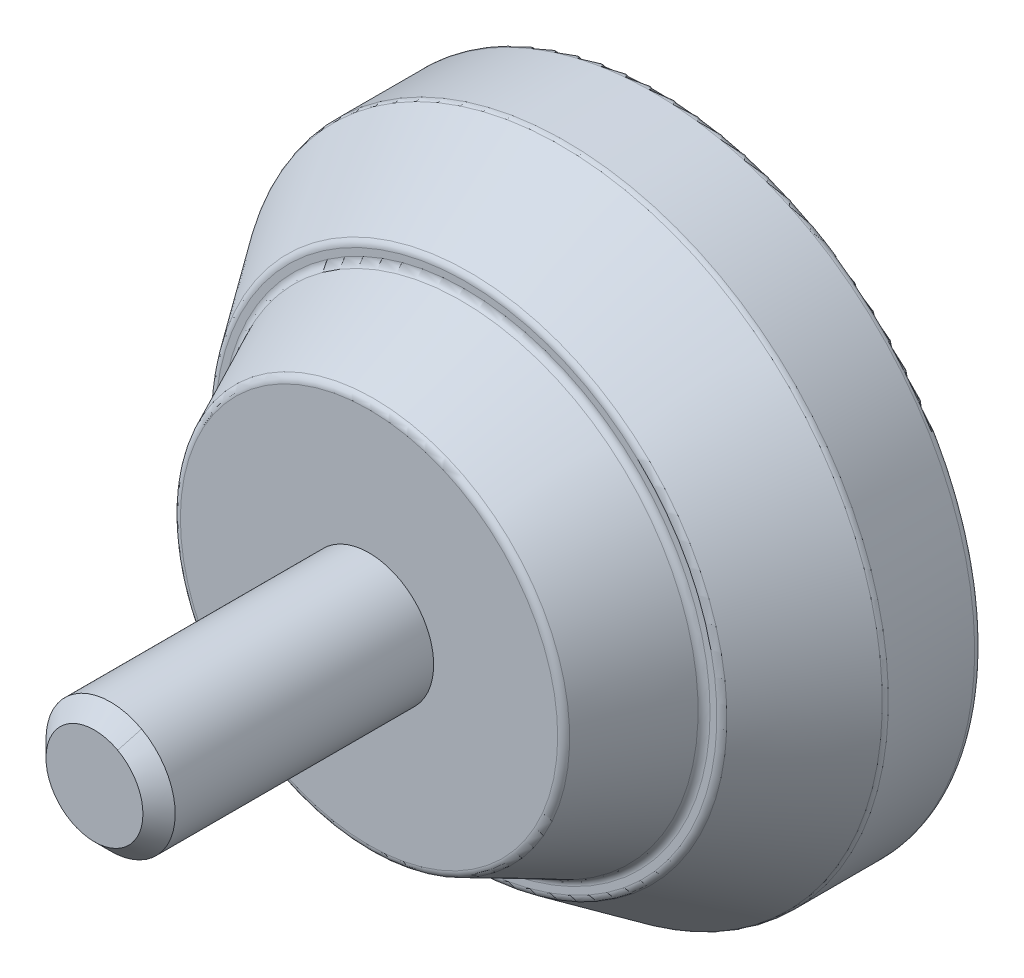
ISO-10303-21;
HEADER;
FILE_DESCRIPTION(('STEP AP214'),'2;1');
FILE_NAME('part.step','',(''),(''),'','','');
FILE_SCHEMA(('AUTOMOTIVE_DESIGN { 1 0 10303 214 1 1 1 1 }'));
ENDSEC;
DATA;
#1=APPLICATION_CONTEXT('core data for automotive mechanical design processes');
#2=APPLICATION_PROTOCOL_DEFINITION('international standard','automotive_design',2000,#1);
#3=PRODUCT_CONTEXT('',#1,'mechanical');
#4=PRODUCT('Part','Part','',(#3));
#5=PRODUCT_RELATED_PRODUCT_CATEGORY('part','',(#4));
#6=PRODUCT_DEFINITION_FORMATION('','',#4);
#7=PRODUCT_DEFINITION_CONTEXT('part definition',#1,'design');
#8=PRODUCT_DEFINITION('design','',#6,#7);
#9=PRODUCT_DEFINITION_SHAPE('','',#8);
#10=(LENGTH_UNIT() NAMED_UNIT(*) SI_UNIT(.MILLI.,.METRE.));
#11=(NAMED_UNIT(*) PLANE_ANGLE_UNIT() SI_UNIT($,.RADIAN.));
#12=(NAMED_UNIT(*) SI_UNIT($,.STERADIAN.) SOLID_ANGLE_UNIT());
#13=UNCERTAINTY_MEASURE_WITH_UNIT(LENGTH_MEASURE(1.E-05),#10,'distance_accuracy_value','');
#14=(GEOMETRIC_REPRESENTATION_CONTEXT(3) GLOBAL_UNCERTAINTY_ASSIGNED_CONTEXT((#13)) GLOBAL_UNIT_ASSIGNED_CONTEXT((#10,
#11,#12)) REPRESENTATION_CONTEXT('',''));
#15=CARTESIAN_POINT('',(0.,0.,0.));
#16=DIRECTION('',(0.,0.,1.));
#17=DIRECTION('',(1.,0.,0.));
#18=AXIS2_PLACEMENT_3D('',#15,#16,#17);
#19=CARTESIAN_POINT('',(0.,0.,0.));
#20=DIRECTION('',(0.,0.,-1.));
#21=DIRECTION('',(-1.,0.,0.));
#22=AXIS2_PLACEMENT_3D('',#19,#20,#21);
#23=PLANE('',#22);
#24=CARTESIAN_POINT('',(0.,0.,0.));
#25=DIRECTION('',(0.,0.,1.));
#26=DIRECTION('',(-0.479425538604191,-0.877582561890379,0.));
#27=AXIS2_PLACEMENT_3D('',#24,#25,#26);
#28=CIRCLE('',#27,6.03950893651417);
#29=CARTESIAN_POINT('',(-2.89549495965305,-5.30016765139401,0.));
#30=VERTEX_POINT('',#29);
#31=CARTESIAN_POINT('',(2.89549482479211,5.30016772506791,0.));
#32=VERTEX_POINT('',#31);
#33=EDGE_CURVE('P0_E81',#30,#32,#28,.T.);
#34=ORIENTED_EDGE('',*,*,#33,.F.);
#35=CARTESIAN_POINT('',(0.,0.,0.));
#36=DIRECTION('',(0.,0.,1.));
#37=DIRECTION('',(0.479425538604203,0.877582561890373,0.));
#38=AXIS2_PLACEMENT_3D('',#35,#36,#37);
#39=CIRCLE('',#38,6.03950893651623);
#40=EDGE_CURVE('P0_E77',#32,#30,#39,.T.);
#41=ORIENTED_EDGE('',*,*,#40,.F.);
#42=EDGE_LOOP('',(#34,#41));
#43=FACE_BOUND('',#42,.T.);
#44=ADVANCED_FACE('P0_F16',(#43),#23,.T.);
#45=CARTESIAN_POINT('',(0.,0.,0.5));
#46=DIRECTION('',(0.,0.,-1.));
#47=DIRECTION('',(0.479425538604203,0.877582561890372,0.));
#48=AXIS2_PLACEMENT_3D('',#45,#46,#47);
#49=TOROIDAL_SURFACE('',#48,6.03950893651,0.5);
#50=CARTESIAN_POINT('',(0.,0.,0.213211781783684));
#51=DIRECTION('',(0.,0.,1.));
#52=DIRECTION('',(0.479425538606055,0.877582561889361,0.));
#53=AXIS2_PLACEMENT_3D('',#50,#51,#52);
#54=CIRCLE('',#53,6.44908495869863);
#55=CARTESIAN_POINT('',(3.0918560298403,5.65960449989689,0.213211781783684));
#56=VERTEX_POINT('',#55);
#57=EDGE_CURVE('P0_E87',#56,#56,#54,.T.);
#58=ORIENTED_EDGE('',*,*,#57,.F.);
#59=EDGE_LOOP('',(#58));
#60=FACE_BOUND('',#59,.T.);
#61=ORIENTED_EDGE('',*,*,#33,.T.);
#62=ORIENTED_EDGE('',*,*,#40,.T.);
#63=EDGE_LOOP('',(#61,#62));
#64=FACE_BOUND('',#63,.T.);
#65=ADVANCED_FACE('P0_F86',(#60,#64),#49,.T.);
#66=CARTESIAN_POINT('',(0.,0.,0.415064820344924));
#67=DIRECTION('',(0.,0.,1.));
#68=DIRECTION('',(1.,0.,0.));
#69=AXIS2_PLACEMENT_3D('',#66,#67,#68);
#70=CONICAL_SURFACE('',#69,6.59042397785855,0.610865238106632);
#71=CARTESIAN_POINT('',(0.,0.,0.415064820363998));
#72=DIRECTION('',(0.,0.,1.));
#73=DIRECTION('',(-0.903693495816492,-0.428179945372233,0.));
#74=AXIS2_PLACEMENT_3D('',#71,#72,#73);
#75=CIRCLE('',#74,6.59042397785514);
#76=CARTESIAN_POINT('',(-5.95572328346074,-2.82188737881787,0.415064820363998));
#77=VERTEX_POINT('',#76);
#78=EDGE_CURVE('P0_E111',#77,#77,#75,.F.);
#79=ORIENTED_EDGE('',*,*,#78,.T.);
#80=EDGE_LOOP('',(#79));
#81=FACE_BOUND('',#80,.T.);
#82=ORIENTED_EDGE('',*,*,#57,.T.);
#83=EDGE_LOOP('',(#82));
#84=FACE_BOUND('',#83,.T.);
#85=ADVANCED_FACE('P0_F104',(#81,#84),#70,.T.);
#86=CARTESIAN_POINT('',(0.,0.,0.128276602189));
#87=DIRECTION('',(0.,0.,1.));
#88=DIRECTION('',(-0.903693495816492,-0.428179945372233,0.));
#89=AXIS2_PLACEMENT_3D('',#86,#87,#88);
#90=TOROIDAL_SURFACE('',#89,7.,0.5);
#91=CARTESIAN_POINT('',(0.,0.,0.415064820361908));
#92=DIRECTION('',(0.,0.,-1.));
#93=DIRECTION('',(0.479425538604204,0.877582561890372,0.));
#94=AXIS2_PLACEMENT_3D('',#91,#92,#93);
#95=CIRCLE('',#94,7.40957602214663);
#96=CARTESIAN_POINT('',(3.55233997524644,6.50251470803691,0.415064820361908));
#97=VERTEX_POINT('',#96);
#98=EDGE_CURVE('P0_E124',#97,#97,#95,.T.);
#99=ORIENTED_EDGE('',*,*,#98,.T.);
#100=EDGE_LOOP('',(#99));
#101=FACE_BOUND('',#100,.T.);
#102=ORIENTED_EDGE('',*,*,#78,.F.);
#103=EDGE_LOOP('',(#102));
#104=FACE_BOUND('',#103,.T.);
#105=ADVANCED_FACE('P0_F137',(#101,#104),#90,.F.);
#106=CARTESIAN_POINT('',(0.,0.,0.213211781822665));
#107=DIRECTION('',(0.,0.,-1.));
#108=DIRECTION('',(-1.,0.,0.));
#109=AXIS2_PLACEMENT_3D('',#106,#107,#108);
#110=CONICAL_SURFACE('',#109,7.55091504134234,0.610865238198);
#111=ORIENTED_EDGE('',*,*,#98,.F.);
#112=EDGE_LOOP('',(#111));
#113=FACE_BOUND('',#112,.T.);
#114=CARTESIAN_POINT('',(0.,0.,0.213211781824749));
#115=DIRECTION('',(0.,0.,-1.));
#116=DIRECTION('',(0.479425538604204,0.877582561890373,0.));
#117=AXIS2_PLACEMENT_3D('',#114,#115,#116);
#118=CIRCLE('',#117,7.55091504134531);
#119=CARTESIAN_POINT('',(3.62010151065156,6.62655136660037,0.213211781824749));
#120=VERTEX_POINT('',#119);
#121=EDGE_CURVE('P0_E128',#120,#120,#118,.F.);
#122=ORIENTED_EDGE('',*,*,#121,.F.);
#123=EDGE_LOOP('',(#122));
#124=FACE_BOUND('',#123,.T.);
#125=ADVANCED_FACE('P0_F140',(#113,#124),#110,.F.);
#126=CARTESIAN_POINT('',(0.,0.,0.5));
#127=DIRECTION('',(0.,0.,-1.));
#128=DIRECTION('',(0.479425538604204,0.877582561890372,0.));
#129=AXIS2_PLACEMENT_3D('',#126,#127,#128);
#130=TOROIDAL_SURFACE('',#129,7.96049106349,0.5);
#131=CARTESIAN_POINT('',(-3.81646260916,-6.98598819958,0.));
#132=CARTESIAN_POINT('',(-3.93077201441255,-6.92354383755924,0.));
#133=CARTESIAN_POINT('',(-4.04354593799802,-6.85828928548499,0.));
#134=CARTESIAN_POINT('',(-4.26575747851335,-6.72232736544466,0.));
#135=CARTESIAN_POINT('',(-4.37519509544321,-6.65161999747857,0.));
#136=CARTESIAN_POINT('',(-4.59046867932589,-6.50492000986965,0.));
#137=CARTESIAN_POINT('',(-4.6963046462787,-6.42892739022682,0.));
#138=CARTESIAN_POINT('',(-4.90412041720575,-6.27184071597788,0.));
#139=CARTESIAN_POINT('',(-5.00610022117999,-6.19074666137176,0.));
#140=CARTESIAN_POINT('',(-5.20595786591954,-6.02365228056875,0.));
#141=CARTESIAN_POINT('',(-5.30383570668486,-5.93765195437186,0.));
#142=CARTESIAN_POINT('',(-5.49525366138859,-5.7609522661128,0.));
#143=CARTESIAN_POINT('',(-5.58879377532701,-5.67025290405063,0.));
#144=CARTESIAN_POINT('',(-5.77131092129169,-5.48437363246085,0.));
#145=CARTESIAN_POINT('',(-5.86028795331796,-5.38919372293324,0.));
#146=CARTESIAN_POINT('',(-6.03346458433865,-5.19458265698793,0.));
#147=CARTESIAN_POINT('',(-6.11766418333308,-5.09515150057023,0.));
#148=CARTESIAN_POINT('',(-6.28108310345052,-4.89227747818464,0.));
#149=CARTESIAN_POINT('',(-6.36030242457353,-4.78883461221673,0.));
#150=CARTESIAN_POINT('',(-6.51356994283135,-4.57818637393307,0.));
#151=CARTESIAN_POINT('',(-6.58761813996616,-4.47098100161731,0.));
#152=CARTESIAN_POINT('',(-6.73036502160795,-4.25306601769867,0.));
#153=CARTESIAN_POINT('',(-6.79906370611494,-4.14235640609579,0.));
#154=CARTESIAN_POINT('',(-6.9309460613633,-3.91769965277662,0.));
#155=CARTESIAN_POINT('',(-6.99412973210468,-3.80375251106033,0.));
#156=CARTESIAN_POINT('',(-7.11482984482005,-3.57289520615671,0.));
#157=CARTESIAN_POINT('',(-7.17234628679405,-3.45598504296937,0.));
#158=CARTESIAN_POINT('',(-7.28157337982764,-3.21948334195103,0.));
#159=CARTESIAN_POINT('',(-7.33328403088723,-3.09989180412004,0.));
#160=CARTESIAN_POINT('',(-7.43077496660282,-2.85831546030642,0.));
#161=CARTESIAN_POINT('',(-7.47655525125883,-2.7363306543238,0.));
#162=CARTESIAN_POINT('',(-7.56207516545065,-2.4902616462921,0.));
#163=CARTESIAN_POINT('',(-7.60181479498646,-2.36617744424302,0.));
#164=CARTESIAN_POINT('',(-7.6751576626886,-2.11620857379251,0.));
#165=CARTESIAN_POINT('',(-7.70876090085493,-1.99032390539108,0.));
#166=CARTESIAN_POINT('',(-7.7697500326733,-1.73705736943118,0.));
#167=CARTESIAN_POINT('',(-7.79713592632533,-1.60967550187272,0.));
#168=CARTESIAN_POINT('',(-7.84562439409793,-1.35372144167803,0.));
#169=CARTESIAN_POINT('',(-7.86672696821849,-1.2251492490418,0.));
#170=CARTESIAN_POINT('',(-7.90259795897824,-0.967124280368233,0.));
#171=CARTESIAN_POINT('',(-7.91736637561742,-0.837671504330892,0.));
#172=CARTESIAN_POINT('',(-7.9405334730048,-0.578197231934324,0.));
#173=CARTESIAN_POINT('',(-7.94893215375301,-0.448175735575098,0.));
#174=CARTESIAN_POINT('',(-7.95933954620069,-0.187877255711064,0.));
#175=CARTESIAN_POINT('',(-7.96134825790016,-0.0576002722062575,0.));
#176=CARTESIAN_POINT('',(-7.9589708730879,0.20289533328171,0.));
#177=CARTESIAN_POINT('',(-7.95458477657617,0.333113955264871,0.));
#178=CARTESIAN_POINT('',(-7.93942834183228,0.593179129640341,0.));
#179=CARTESIAN_POINT('',(-7.92865800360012,0.723025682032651,0.));
#180=CARTESIAN_POINT('',(-7.9007590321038,0.982033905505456,0.));
#181=CARTESIAN_POINT('',(-7.88363039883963,1.11119557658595,0.));
#182=CARTESIAN_POINT('',(-7.84305610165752,1.36852287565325,0.));
#183=CARTESIAN_POINT('',(-7.81961043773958,1.49668850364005,0.));
#184=CARTESIAN_POINT('',(-7.76645856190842,1.75171495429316,0.));
#185=CARTESIAN_POINT('',(-7.73675234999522,1.87857577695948,0.));
#186=CARTESIAN_POINT('',(-7.67115094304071,2.13068699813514,0.));
#187=CARTESIAN_POINT('',(-7.63525574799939,2.25593739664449,0.));
#188=CARTESIAN_POINT('',(-7.55736284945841,2.50452603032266,0.));
#189=CARTESIAN_POINT('',(-7.51536514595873,2.62786426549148,0.));
#190=CARTESIAN_POINT('',(-7.42536840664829,2.87233143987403,0.));
#191=CARTESIAN_POINT('',(-7.37736937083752,2.99346037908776,0.));
#192=CARTESIAN_POINT('',(-7.27548560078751,3.23321715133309,0.));
#193=CARTESIAN_POINT('',(-7.22160086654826,3.35184498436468,0.));
#194=CARTESIAN_POINT('',(-7.10807551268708,3.58631375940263,0.));
#195=CARTESIAN_POINT('',(-7.04843489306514,3.70215470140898,0.));
#196=CARTESIAN_POINT('',(-6.92354144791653,3.93077062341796,0.));
#197=CARTESIAN_POINT('',(-6.85828862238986,4.04354560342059,0.));
#198=CARTESIAN_POINT('',(-6.72232796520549,4.26575791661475,0.));
#199=CARTESIAN_POINT('',(-6.65162013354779,4.37519524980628,0.));
#200=CARTESIAN_POINT('',(-6.50491980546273,4.59046862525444,0.));
#201=CARTESIAN_POINT('',(-6.42892730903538,4.69630466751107,0.));
#202=CARTESIAN_POINT('',(-6.27184072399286,4.90412049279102,0.));
#203=CARTESIAN_POINT('',(-6.19074663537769,5.00610027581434,0.));
#204=CARTESIAN_POINT('',(-6.0236522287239,5.20595790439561,0.));
#205=CARTESIAN_POINT('',(-5.93765191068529,5.30383574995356,0.));
#206=CARTESIAN_POINT('',(-5.76095222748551,5.49525370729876,0.));
#207=CARTESIAN_POINT('',(-5.67025286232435,5.58879381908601,0.));
#208=CARTESIAN_POINT('',(-5.48437358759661,5.77131096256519,0.));
#209=CARTESIAN_POINT('',(-5.38919367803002,5.86028799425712,0.));
#210=CARTESIAN_POINT('',(-5.19458261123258,6.03346462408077,0.));
#211=CARTESIAN_POINT('',(-5.09515145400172,6.11766422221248,0.));
#212=CARTESIAN_POINT('',(-4.89227743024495,6.28108314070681,0.));
#213=CARTESIAN_POINT('',(-4.78883456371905,6.36030246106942,0.));
#214=CARTESIAN_POINT('',(-4.57818632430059,6.51356997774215,0.));
#215=CARTESIAN_POINT('',(-4.47098095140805,6.58761817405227,0.));
#216=CARTESIAN_POINT('',(-4.25306596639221,6.7303650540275,0.));
#217=CARTESIAN_POINT('',(-4.14235635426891,6.79906373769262,0.));
#218=CARTESIAN_POINT('',(-3.91769959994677,6.93094609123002,0.));
#219=CARTESIAN_POINT('',(-3.80375245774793,6.99412976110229,0.));
#220=CARTESIAN_POINT('',(-3.57289515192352,7.11482987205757,0.));
#221=CARTESIAN_POINT('',(-3.45598498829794,7.17234631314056,0.));
#222=CARTESIAN_POINT('',(-3.21948328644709,7.28157340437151,0.));
#223=CARTESIAN_POINT('',(-3.09989174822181,7.33328405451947,0.));
#224=CARTESIAN_POINT('',(-2.85831540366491,7.43077498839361,0.));
#225=CARTESIAN_POINT('',(-2.73633059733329,7.47655527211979,0.));
#226=CARTESIAN_POINT('',(-2.49026158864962,7.56207518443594,0.));
#227=CARTESIAN_POINT('',(-2.36617738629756,7.60181481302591,0.));
#228=CARTESIAN_POINT('',(-2.11620851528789,7.67515767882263,0.));
#229=CARTESIAN_POINT('',(-1.99032384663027,7.70876091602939,0.));
#230=CARTESIAN_POINT('',(-1.73705731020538,7.76975004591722,0.));
#231=CARTESIAN_POINT('',(-1.60967544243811,7.79713593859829,0.));
#232=CARTESIAN_POINT('',(-1.35372138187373,7.8456244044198,0.));
#233=CARTESIAN_POINT('',(-1.22514918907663,7.86672697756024,0.));
#234=CARTESIAN_POINT('',(-0.967124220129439,7.90259796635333,0.));
#235=CARTESIAN_POINT('',(-0.837671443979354,7.91736638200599,0.));
#236=CARTESIAN_POINT('',(-0.578197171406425,7.94053347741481,0.));
#237=CARTESIAN_POINT('',(-0.448175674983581,7.94893215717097,0.));
#238=CARTESIAN_POINT('',(-0.187877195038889,7.95933954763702,0.));
#239=CARTESIAN_POINT('',(-0.0576002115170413,7.96134825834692,0.));
#240=CARTESIAN_POINT('',(0.2028953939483,7.95897087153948,0.));
#241=CARTESIAN_POINT('',(0.333114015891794,7.95458477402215,0.));
#242=CARTESIAN_POINT('',(0.593179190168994,7.93942833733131,0.));
#243=CARTESIAN_POINT('',(0.7230257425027,7.9286579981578,0.));
#244=CARTESIAN_POINT('',(0.982033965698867,7.9007590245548,0.));
#245=CARTESIAN_POINT('',(1.11119563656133,7.88363039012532,0.));
#246=CARTESIAN_POINT('',(1.36852293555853,7.84305609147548,0.));
#247=CARTESIAN_POINT('',(1.49668856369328,7.81961042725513,0.));
#248=CARTESIAN_POINT('',(1.751715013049,7.76645854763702,0.));
#249=CARTESIAN_POINT('',(1.87857583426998,7.73675233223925,0.));
#250=CARTESIAN_POINT('',(2.13068705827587,7.67115093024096,0.));
#251=CARTESIAN_POINT('',(2.25593746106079,7.63525574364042,0.));
#252=CARTESIAN_POINT('',(2.50452608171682,7.55736281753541,0.));
#253=CARTESIAN_POINT('',(2.62786429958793,7.51536507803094,0.));
#254=CARTESIAN_POINT('',(2.87233151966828,7.42536843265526,0.));
#255=CARTESIAN_POINT('',(2.99346052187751,7.37736952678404,0.));
#256=CARTESIAN_POINT('',(3.23321712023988,7.27548539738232,0.));
#257=CARTESIAN_POINT('',(3.35184471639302,7.2216001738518,0.));
#258=CARTESIAN_POINT('',(3.58631413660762,7.10807615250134,0.));
#259=CARTESIAN_POINT('',(3.70215596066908,7.0484373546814,0.));
#260=CARTESIAN_POINT('',(3.81646271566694,6.98598814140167,0.));
#261=B_SPLINE_CURVE_WITH_KNOTS('',3,(#131,#132,#133,#134,#135,#136,#137,#138,#139,#140,#141,
#142,#143,#144,#145,#146,#147,#148,#149,#150,#151,#152,#153,#154,#155,#156,#157,#158,#159,#160,
#161,#162,#163,#164,#165,#166,#167,#168,#169,#170,#171,#172,#173,#174,#175,#176,#177,#178,#179,
#180,#181,#182,#183,#184,#185,#186,#187,#188,#189,#190,#191,#192,#193,#194,#195,#196,#197,#198,
#199,#200,#201,#202,#203,#204,#205,#206,#207,#208,#209,#210,#211,#212,#213,#214,#215,#216,#217,
#218,#219,#220,#221,#222,#223,#224,#225,#226,#227,#228,#229,#230,#231,#232,#233,#234,#235,#236,
#237,#238,#239,#240,#241,#242,#243,#244,#245,#246,#247,#248,#249,#250,#251,#252,#253,#254,#255,
#256,#257,#258,#259,#260),.UNSPECIFIED.,.F.,.F.,(4,2,2,2,2,2,2,2,2,2,2,2,2,2,2,2,2,2,2,2,2,2,2,
2,2,2,2,2,2,2,2,2,2,2,2,2,2,2,2,2,2,2,2,2,2,2,2,2,2,2,2,2,2,2,2,2,2,2,2,2,2,2,2,2,4),(0.,
0.390720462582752,0.781440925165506,1.17216138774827,1.56288185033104,1.95360231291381,
2.34432277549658,2.73504323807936,3.12576370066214,3.51648416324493,3.90720462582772,
4.29792508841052,4.68864555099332,5.07936601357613,5.47008647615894,5.86080693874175,
6.25152740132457,6.64224786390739,7.03296832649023,7.42368878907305,7.81440925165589,
8.20512971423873,8.59585017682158,8.98657063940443,9.37729110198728,9.76801156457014,
10.158732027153,10.5494524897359,10.9401729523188,11.3308934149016,11.7216138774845,
12.1123343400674,12.5030548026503,12.8937752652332,13.2844957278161,13.675216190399,
14.0659366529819,14.4566571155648,14.8473775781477,15.2380980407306,15.6288185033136,
16.0195389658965,16.4102594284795,16.8009798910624,17.1917003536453,17.5824208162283,
17.9731412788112,18.3638617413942,18.7545822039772,19.1453026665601,19.5360231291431,
19.9267435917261,20.3174640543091,20.708184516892,21.098904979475,21.489625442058,
21.880345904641,22.271066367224,22.661786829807,23.05250729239,23.4432277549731,
23.8339482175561,24.2246686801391,24.6153891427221,25.0061096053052),.UNSPECIFIED.);
#262=CARTESIAN_POINT('',(3.81646271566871,6.98598814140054,0.));
#263=VERTEX_POINT('',#262);
#264=CARTESIAN_POINT('',(-3.81646263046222,-6.98598818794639,0.));
#265=VERTEX_POINT('',#264);
#266=EDGE_CURVE('P0_E133',#263,#265,#261,.F.);
#267=ORIENTED_EDGE('',*,*,#266,.F.);
#268=CARTESIAN_POINT('',(0.,0.,0.));
#269=DIRECTION('',(0.,0.,-1.));
#270=DIRECTION('',(0.479425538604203,0.877582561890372,0.));
#271=AXIS2_PLACEMENT_3D('',#268,#269,#270);
#272=CIRCLE('',#271,7.96049106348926);
#273=EDGE_CURVE('P0_E162',#265,#263,#272,.F.);
#274=ORIENTED_EDGE('',*,*,#273,.F.);
#275=EDGE_LOOP('',(#267,#274));
#276=FACE_BOUND('',#275,.T.);
#277=ORIENTED_EDGE('',*,*,#121,.T.);
#278=EDGE_LOOP('',(#277));
#279=FACE_BOUND('',#278,.T.);
#280=ADVANCED_FACE('P0_F143',(#276,#279),#130,.T.);
#281=CARTESIAN_POINT('',(0.,0.,0.));
#282=DIRECTION('',(0.,0.,-1.));
#283=DIRECTION('',(-1.,0.,0.));
#284=AXIS2_PLACEMENT_3D('',#281,#282,#283);
#285=PLANE('',#284);
#286=ORIENTED_EDGE('',*,*,#266,.T.);
#287=ORIENTED_EDGE('',*,*,#273,.T.);
#288=EDGE_LOOP('',(#286,#287));
#289=FACE_BOUND('',#288,.T.);
#290=CARTESIAN_POINT('',(0.,0.,0.));
#291=DIRECTION('',(0.,0.,1.));
#292=DIRECTION('',(-0.4794255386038,-0.877582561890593,0.));
#293=AXIS2_PLACEMENT_3D('',#290,#291,#292);
#294=CIRCLE('',#293,14.0395089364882);
#295=CARTESIAN_POINT('',(-6.73089928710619,-12.3208281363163,0.));
#296=VERTEX_POINT('',#295);
#297=CARTESIAN_POINT('',(6.73089913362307,12.3208282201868,0.));
#298=VERTEX_POINT('',#297);
#299=EDGE_CURVE('P0_E175',#296,#298,#294,.T.);
#300=ORIENTED_EDGE('',*,*,#299,.F.);
#301=CARTESIAN_POINT('',(6.73089913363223,12.3208282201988,0.));
#302=CARTESIAN_POINT('',(6.52930218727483,12.430966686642,0.));
#303=CARTESIAN_POINT('',(6.32499791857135,12.536148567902,0.));
#304=CARTESIAN_POINT('',(5.91147625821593,12.7363650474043,0.));
#305=CARTESIAN_POINT('',(5.702258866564,12.8313996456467,0.));
#306=CARTESIAN_POINT('',(5.27941248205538,13.0110874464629,0.));
#307=CARTESIAN_POINT('',(5.0657834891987,13.0957406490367,0.));
#308=CARTESIAN_POINT('',(4.63462922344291,13.2544631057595,0.));
#309=CARTESIAN_POINT('',(4.41710395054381,13.3285323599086,0.));
#310=CARTESIAN_POINT('',(3.97868098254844,13.4659081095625,0.));
#311=CARTESIAN_POINT('',(3.75778328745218,13.5292146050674,0.));
#312=CARTESIAN_POINT('',(3.31314768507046,13.6449124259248,0.));
#313=CARTESIAN_POINT('',(3.089409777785,13.6973037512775,0.));
#314=CARTESIAN_POINT('',(2.63963274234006,13.7910449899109,0.));
#315=CARTESIAN_POINT('',(2.41359361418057,13.8323949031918,0.));
#316=CARTESIAN_POINT('',(1.95975868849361,13.9039537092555,0.));
#317=CARTESIAN_POINT('',(1.73196289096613,13.9341626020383,0.));
#318=CARTESIAN_POINT('',(1.27516340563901,13.9833665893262,0.));
#319=CARTESIAN_POINT('',(1.04615971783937,14.0023616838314,0.));
#320=CARTESIAN_POINT('',(0.587496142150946,14.0290923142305,0.));
#321=CARTESIAN_POINT('',(0.357836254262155,14.0368278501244,0.));
#322=CARTESIAN_POINT('',(-0.101586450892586,14.0410207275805,0.));
#323=CARTESIAN_POINT('',(-0.331349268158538,14.0374780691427,0.));
#324=CARTESIAN_POINT('',(-0.79042431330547,14.0191230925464,0.));
#325=CARTESIAN_POINT('',(-1.01973654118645,14.004310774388,0.));
#326=CARTESIAN_POINT('',(-1.47735797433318,13.9634521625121,0.));
#327=CARTESIAN_POINT('',(-1.70566717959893,13.9374058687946,0.));
#328=CARTESIAN_POINT('',(-2.16073255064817,13.8741420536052,0.));
#329=CARTESIAN_POINT('',(-2.38748871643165,13.8369245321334,0.));
#330=CARTESIAN_POINT('',(-2.83890173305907,13.7514079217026,0.));
#331=CARTESIAN_POINT('',(-3.063558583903,13.7031088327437,0.));
#332=CARTESIAN_POINT('',(-3.51023175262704,13.5955454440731,0.));
#333=CARTESIAN_POINT('',(-3.73224807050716,13.5362811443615,0.));
#334=CARTESIAN_POINT('',(-4.17310531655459,13.4069301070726,0.));
#335=CARTESIAN_POINT('',(-4.3919462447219,13.3368433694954,0.));
#336=CARTESIAN_POINT('',(-4.82592550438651,13.1860163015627,0.));
#337=CARTESIAN_POINT('',(-5.04106383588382,13.1052759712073,0.));
#338=CARTESIAN_POINT('',(-5.46711961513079,12.9333362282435,0.));
#339=CARTESIAN_POINT('',(-5.67803706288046,12.8421368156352,0.));
#340=CARTESIAN_POINT('',(-6.09514295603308,12.6494986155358,0.));
#341=CARTESIAN_POINT('',(-6.30133140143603,12.5480598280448,0.));
#342=CARTESIAN_POINT('',(-6.70848256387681,12.3351872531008,0.));
#343=CARTESIAN_POINT('',(-6.90944528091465,12.2237534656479,0.));
#344=CARTESIAN_POINT('',(-7.30566084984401,11.9911593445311,0.));
#345=CARTESIAN_POINT('',(-7.50091370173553,11.8699990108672,0.));
#346=CARTESIAN_POINT('',(-7.88523915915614,11.6182436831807,0.));
#347=CARTESIAN_POINT('',(-8.07431176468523,11.4876486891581,0.));
#348=CARTESIAN_POINT('',(-8.44582123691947,11.2173386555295,0.));
#349=CARTESIAN_POINT('',(-8.62825810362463,11.0776236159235,0.));
#350=CARTESIAN_POINT('',(-8.98605659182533,10.7894100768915,0.));
#351=CARTESIAN_POINT('',(-9.16141821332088,10.6409115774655,0.));
#352=CARTESIAN_POINT('',(-9.50464374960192,10.3354888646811,0.));
#353=CARTESIAN_POINT('',(-9.67250766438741,10.1785646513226,0.));
#354=CARTESIAN_POINT('',(-10.0003333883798,9.85666855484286,0.));
#355=CARTESIAN_POINT('',(-10.1602951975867,9.69169667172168,0.));
#356=CARTESIAN_POINT('',(-10.4719313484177,9.35410266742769,0.));
#357=CARTESIAN_POINT('',(-10.6236056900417,9.18148054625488,0.));
#358=CARTESIAN_POINT('',(-10.9183015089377,8.82900192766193,0.));
#359=CARTESIAN_POINT('',(-11.0613229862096,8.64914543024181,0.));
#360=CARTESIAN_POINT('',(-11.33836852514,8.28263134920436,0.));
#361=CARTESIAN_POINT('',(-11.4723925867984,8.09597376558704,0.));
#362=CARTESIAN_POINT('',(-11.7311204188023,7.71630718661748,0.));
#363=CARTESIAN_POINT('',(-11.8558241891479,7.52329819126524,0.));
#364=CARTESIAN_POINT('',(-12.0956110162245,7.1313937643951,0.));
#365=CARTESIAN_POINT('',(-12.2106940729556,6.93249833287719,0.));
#366=CARTESIAN_POINT('',(-12.4309622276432,6.52930019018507,0.));
#367=CARTESIAN_POINT('',(-12.5361473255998,6.32499747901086,0.));
#368=CARTESIAN_POINT('',(-12.7363661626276,5.91147696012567,0.));
#369=CARTESIAN_POINT('',(-12.8313999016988,5.70225915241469,0.));
#370=CARTESIAN_POINT('',(-13.0110870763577,5.27941246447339,0.));
#371=CARTESIAN_POINT('',(-13.0957405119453,5.06578358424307,0.));
#372=CARTESIAN_POINT('',(-13.2544631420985,4.63462940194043,0.));
#373=CARTESIAN_POINT('',(-13.3285323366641,4.41710409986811,0.));
#374=CARTESIAN_POINT('',(-13.4659080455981,3.97868111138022,0.));
#375=CARTESIAN_POINT('',(-13.5292145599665,3.75778342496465,0.));
#376=CARTESIAN_POINT('',(-13.6449123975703,3.31314782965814,0.));
#377=CARTESIAN_POINT('',(-13.6973037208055,3.08940992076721,0.));
#378=CARTESIAN_POINT('',(-13.791044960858,2.6396328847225,0.));
#379=CARTESIAN_POINT('',(-13.8323948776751,2.41359375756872,0.));
#380=CARTESIAN_POINT('',(-13.9039536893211,1.95975883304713,0.));
#381=CARTESIAN_POINT('',(-13.93416258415,1.73196303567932,0.));
#382=CARTESIAN_POINT('',(-13.9833665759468,1.27516355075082,0.));
#383=CARTESIAN_POINT('',(-14.0023616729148,1.04615986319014,0.));
#384=CARTESIAN_POINT('',(-14.0290923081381,0.587496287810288,0.));
#385=CARTESIAN_POINT('',(-14.0368278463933,0.357836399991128,0.));
#386=CARTESIAN_POINT('',(-14.0410207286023,-0.101586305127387,0.));
#387=CARTESIAN_POINT('',(-14.0374780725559,-0.331349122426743,0.));
#388=CARTESIAN_POINT('',(-14.0191231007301,-0.79042416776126,0.));
#389=CARTESIAN_POINT('',(-14.0043107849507,-1.01973639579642,0.));
#390=CARTESIAN_POINT('',(-13.9634521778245,-1.47735782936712,0.));
#391=CARTESIAN_POINT('',(-13.9374058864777,-1.70566703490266,0.));
#392=CARTESIAN_POINT('',(-13.8741420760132,-2.16073240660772,0.));
#393=CARTESIAN_POINT('',(-13.8369245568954,-2.38748857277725,0.));
#394=CARTESIAN_POINT('',(-13.7514079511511,-2.83890159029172,0.));
#395=CARTESIAN_POINT('',(-13.7031088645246,-3.06355844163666,0.));
#396=CARTESIAN_POINT('',(-13.5955454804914,-3.5102316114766,0.));
#397=CARTESIAN_POINT('',(-13.5362811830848,-3.73224792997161,0.));
#398=CARTESIAN_POINT('',(-13.406930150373,-4.17310517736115,0.));
#399=CARTESIAN_POINT('',(-13.3368434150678,-4.39194610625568,0.));
#400=CARTESIAN_POINT('',(-13.1860163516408,-4.82592536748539,0.));
#401=CARTESIAN_POINT('',(-13.105276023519,-5.04106369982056,0.));
#402=CARTESIAN_POINT('',(-12.9333362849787,-5.46711948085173,0.));
#403=CARTESIAN_POINT('',(-12.8421368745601,-5.67803692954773,0.));
#404=CARTESIAN_POINT('',(-12.6494986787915,-6.09514282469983,0.));
#405=CARTESIAN_POINT('',(-12.5480598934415,-6.30133127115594,0.));
#406=CARTESIAN_POINT('',(-12.3351873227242,-6.70848243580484,0.));
#407=CARTESIAN_POINT('',(-12.2237535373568,-6.90944515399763,0.));
#408=CARTESIAN_POINT('',(-11.9911594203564,-7.30566072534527,0.));
#409=CARTESIAN_POINT('',(-11.8699990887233,-7.5009135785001,0.));
#410=CARTESIAN_POINT('',(-11.6182437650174,-7.8852390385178,0.));
#411=CARTESIAN_POINT('',(-11.4876487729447,-8.07431164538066,0.));
#412=CARTESIAN_POINT('',(-11.2173387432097,-8.44582112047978,0.));
#413=CARTESIAN_POINT('',(-11.0776237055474,-8.62825798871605,0.));
#414=CARTESIAN_POINT('',(-10.7894101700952,-8.9860564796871,0.));
#415=CARTESIAN_POINT('',(-10.6409116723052,-9.16141810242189,0.));
#416=CARTESIAN_POINT('',(-10.3354889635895,-9.50464364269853,0.));
#417=CARTESIAN_POINT('',(-10.1785647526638,-9.67250756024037,0.));
#418=CARTESIAN_POINT('',(-9.85666865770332,-10.0003332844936,0.));
#419=CARTESIAN_POINT('',(-9.69169677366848,-10.160295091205,0.));
#420=CARTESIAN_POINT('',(-9.35410277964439,-10.4719312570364,0.));
#421=CARTESIAN_POINT('',(-9.18148066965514,-10.6236056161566,0.));
#422=CARTESIAN_POINT('',(-8.82900202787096,-10.9183013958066,0.));
#423=CARTESIAN_POINT('',(-8.64914549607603,-11.0613228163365,0.));
#424=CARTESIAN_POINT('',(-8.28263151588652,-11.3383685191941,0.));
#425=CARTESIAN_POINT('',(-8.09597406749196,-11.4723928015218,0.));
#426=CARTESIAN_POINT('',(-7.7163071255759,-11.7311200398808,0.));
#427=CARTESIAN_POINT('',(-7.52329763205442,-11.8558229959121,0.));
#428=CARTESIAN_POINT('',(-7.13139457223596,-12.0956120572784,0.));
#429=CARTESIAN_POINT('',(-6.93250100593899,-12.2106981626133,0.));
#430=CARTESIAN_POINT('',(-6.73089938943,-12.3208280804,0.));
#431=B_SPLINE_CURVE_WITH_KNOTS('',3,(#301,#302,#303,#304,#305,#306,#307,#308,#309,#310,#311,
#312,#313,#314,#315,#316,#317,#318,#319,#320,#321,#322,#323,#324,#325,#326,#327,#328,#329,#330,
#331,#332,#333,#334,#335,#336,#337,#338,#339,#340,#341,#342,#343,#344,#345,#346,#347,#348,#349,
#350,#351,#352,#353,#354,#355,#356,#357,#358,#359,#360,#361,#362,#363,#364,#365,#366,#367,#368,
#369,#370,#371,#372,#373,#374,#375,#376,#377,#378,#379,#380,#381,#382,#383,#384,#385,#386,#387,
#388,#389,#390,#391,#392,#393,#394,#395,#396,#397,#398,#399,#400,#401,#402,#403,#404,#405,#406,
#407,#408,#409,#410,#411,#412,#413,#414,#415,#416,#417,#418,#419,#420,#421,#422,#423,#424,#425,
#426,#427,#428,#429,#430),.UNSPECIFIED.,.F.,.F.,(4,2,2,2,2,2,2,2,2,2,2,2,2,2,2,2,2,2,2,2,2,2,2,
2,2,2,2,2,2,2,2,2,2,2,2,2,2,2,2,2,2,2,2,2,2,2,2,2,2,2,2,2,2,2,2,2,2,2,2,2,2,2,2,2,4),(0.,
0.68909358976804,1.37818717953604,2.067280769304,2.75637435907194,3.44546794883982,
4.13456153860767,4.8236551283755,5.51274871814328,6.201842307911,6.89093589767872,
7.58002948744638,8.26912307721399,8.9582166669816,9.64731025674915,10.3364038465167,
11.0254974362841,11.7145910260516,12.403684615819,13.0927782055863,13.7818717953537,
14.470965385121,15.1600589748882,15.8491525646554,16.5382461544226,17.2273397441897,
17.9164333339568,18.6055269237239,19.2946205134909,19.9837141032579,20.6728076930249,
21.3619012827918,22.0509948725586,22.7400884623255,23.4291820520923,24.118275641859,
24.8073692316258,25.4964628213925,26.1855564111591,26.8746500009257,27.5637435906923,
28.2528371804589,28.9419307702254,29.6310243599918,30.3201179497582,31.0092115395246,
31.698305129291,32.3873987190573,33.0764923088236,33.7655858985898,34.454679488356,
35.1437730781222,35.8328666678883,36.5219602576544,37.2110538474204,37.9001474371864,
38.5892410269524,39.2783346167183,39.9674282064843,40.6565217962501,41.3456153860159,
42.0347089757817,42.7238025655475,43.4128961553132,44.1019897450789),.UNSPECIFIED.);
#432=EDGE_CURVE('P0_E174',#298,#296,#431,.T.);
#433=ORIENTED_EDGE('',*,*,#432,.F.);
#434=EDGE_LOOP('',(#300,#433));
#435=FACE_BOUND('',#434,.T.);
#436=ADVANCED_FACE('P0_F149',(#289,#435),#285,.T.);
#437=CARTESIAN_POINT('',(0.,0.,0.5));
#438=DIRECTION('',(0.,0.,-1.));
#439=DIRECTION('',(0.479425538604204,0.877582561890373,0.));
#440=AXIS2_PLACEMENT_3D('',#437,#438,#439);
#441=TOROIDAL_SURFACE('',#440,14.0395089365,0.5);
#442=CARTESIAN_POINT('',(0.,0.,0.213211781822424));
#443=DIRECTION('',(0.,0.,1.));
#444=DIRECTION('',(0.479425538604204,0.877582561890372,0.));
#445=AXIS2_PLACEMENT_3D('',#442,#443,#444);
#446=CIRCLE('',#445,14.4490849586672);
#447=CARTESIAN_POINT('',(6.92726033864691,12.6802649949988,0.213211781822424));
#448=VERTEX_POINT('',#447);
#449=EDGE_CURVE('P0_E204',#448,#448,#446,.T.);
#450=ORIENTED_EDGE('',*,*,#449,.F.);
#451=EDGE_LOOP('',(#450));
#452=FACE_BOUND('',#451,.T.);
#453=ORIENTED_EDGE('',*,*,#299,.T.);
#454=ORIENTED_EDGE('',*,*,#432,.T.);
#455=EDGE_LOOP('',(#453,#454));
#456=FACE_BOUND('',#455,.T.);
#457=ADVANCED_FACE('P0_F201',(#452,#456),#441,.T.);
#458=CARTESIAN_POINT('',(0.,0.,0.41506482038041));
#459=DIRECTION('',(0.,0.,1.));
#460=DIRECTION('',(1.,0.,0.));
#461=AXIS2_PLACEMENT_3D('',#458,#459,#460);
#462=CONICAL_SURFACE('',#461,14.590423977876,0.610865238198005);
#463=CARTESIAN_POINT('',(0.,0.,0.415064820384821));
#464=DIRECTION('',(0.,0.,1.));
#465=DIRECTION('',(-0.903693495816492,-0.428179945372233,0.));
#466=AXIS2_PLACEMENT_3D('',#463,#464,#465);
#467=CIRCLE('',#466,14.5904239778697);
#468=CARTESIAN_POINT('',(-13.1852712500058,-6.24732694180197,0.415064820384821));
#469=VERTEX_POINT('',#468);
#470=EDGE_CURVE('P0_E206',#469,#469,#467,.F.);
#471=ORIENTED_EDGE('',*,*,#470,.T.);
#472=EDGE_LOOP('',(#471));
#473=FACE_BOUND('',#472,.T.);
#474=ORIENTED_EDGE('',*,*,#449,.T.);
#475=EDGE_LOOP('',(#474));
#476=FACE_BOUND('',#475,.T.);
#477=ADVANCED_FACE('P0_F228',(#473,#476),#462,.T.);
#478=CARTESIAN_POINT('',(0.,0.,0.128276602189));
#479=DIRECTION('',(0.,0.,1.));
#480=DIRECTION('',(-0.903693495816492,-0.428179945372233,0.));
#481=AXIS2_PLACEMENT_3D('',#478,#479,#480);
#482=TOROIDAL_SURFACE('',#481,15.,0.5);
#483=CARTESIAN_POINT('',(0.,0.,0.415064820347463));
#484=DIRECTION('',(0.,0.,-1.));
#485=DIRECTION('',(0.479425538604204,0.877582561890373,0.));
#486=AXIS2_PLACEMENT_3D('',#483,#484,#485);
#487=CIRCLE('',#486,15.4095760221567);
#488=CARTESIAN_POINT('',(7.38774428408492,13.5231752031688,0.415064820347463));
#489=VERTEX_POINT('',#488);
#490=EDGE_CURVE('P0_E211',#489,#489,#487,.T.);
#491=ORIENTED_EDGE('',*,*,#490,.T.);
#492=EDGE_LOOP('',(#491));
#493=FACE_BOUND('',#492,.T.);
#494=ORIENTED_EDGE('',*,*,#470,.F.);
#495=EDGE_LOOP('',(#494));
#496=FACE_BOUND('',#495,.T.);
#497=ADVANCED_FACE('P0_F460',(#493,#496),#482,.F.);
#498=CARTESIAN_POINT('',(0.,0.,0.213211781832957));
#499=DIRECTION('',(0.,0.,-1.));
#500=DIRECTION('',(-1.,0.,0.));
#501=AXIS2_PLACEMENT_3D('',#498,#499,#500);
#502=CONICAL_SURFACE('',#501,15.5509150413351,0.610865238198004);
#503=ORIENTED_EDGE('',*,*,#490,.F.);
#504=EDGE_LOOP('',(#503));
#505=FACE_BOUND('',#504,.T.);
#506=CARTESIAN_POINT('',(0.,0.,0.213211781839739));
#507=DIRECTION('',(0.,0.,-1.));
#508=DIRECTION('',(0.479425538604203,0.877582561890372,0.));
#509=AXIS2_PLACEMENT_3D('',#506,#507,#508);
#510=CIRCLE('',#509,15.5509150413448);
#511=CARTESIAN_POINT('',(7.45550581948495,13.6472118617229,0.213211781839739));
#512=VERTEX_POINT('',#511);
#513=EDGE_CURVE('P0_E468',#512,#512,#510,.F.);
#514=ORIENTED_EDGE('',*,*,#513,.F.);
#515=EDGE_LOOP('',(#514));
#516=FACE_BOUND('',#515,.T.);
#517=ADVANCED_FACE('P0_F431',(#505,#516),#502,.F.);
#518=CARTESIAN_POINT('',(0.,0.,0.5));
#519=DIRECTION('',(0.,0.,-1.));
#520=DIRECTION('',(0.479425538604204,0.877582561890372,0.));
#521=AXIS2_PLACEMENT_3D('',#518,#519,#520);
#522=TOROIDAL_SURFACE('',#521,15.9604910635,0.5);
#523=CARTESIAN_POINT('',(-7.65186690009,-14.0066487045,0.));
#524=CARTESIAN_POINT('',(-7.88105304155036,-13.8814500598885,0.));
#525=CARTESIAN_POINT('',(-8.10716059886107,-13.7506170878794,0.));
#526=CARTESIAN_POINT('',(-8.5526865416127,-13.4780184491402,0.));
#527=CARTESIAN_POINT('',(-8.77210492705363,-13.33625278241,0.));
#528=CARTESIAN_POINT('',(-9.20372052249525,-13.0421247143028,0.));
#529=CARTESIAN_POINT('',(-9.41591773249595,-12.8897623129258,0.));
#530=CARTESIAN_POINT('',(-9.83258068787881,-12.5748093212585,0.));
#531=CARTESIAN_POINT('',(-10.037046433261,-12.4122187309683,0.));
#532=CARTESIAN_POINT('',(-10.4377536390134,-12.077200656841,0.));
#533=CARTESIAN_POINT('',(-10.6339950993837,-11.9047731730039,0.));
#534=CARTESIAN_POINT('',(-11.0177810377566,-11.5504968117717,0.));
#535=CARTESIAN_POINT('',(-11.2053255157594,-11.3686479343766,0.));
#536=CARTESIAN_POINT('',(-11.5712656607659,-10.9959668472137,0.));
#537=CARTESIAN_POINT('',(-11.7496613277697,-10.8051346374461,0.));
#538=CARTESIAN_POINT('',(-12.0968740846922,-10.4149466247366,0.));
#539=CARTESIAN_POINT('',(-12.2656911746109,-10.2155908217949,0.));
#540=CARTESIAN_POINT('',(-12.5933400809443,-9.80883588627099,0.));
#541=CARTESIAN_POINT('',(-12.752171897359,-9.60143675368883,0.));
#542=CARTESIAN_POINT('',(-13.0594676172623,-9.17909480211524,0.));
#543=CARTESIAN_POINT('',(-13.2079315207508,-8.96415198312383,0.));
#544=CARTESIAN_POINT('',(-13.4941337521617,-8.5272404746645,0.));
#545=CARTESIAN_POINT('',(-13.6318720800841,-8.30527178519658,0.));
#546=CARTESIAN_POINT('',(-13.8962913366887,-7.85484327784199,0.));
#547=CARTESIAN_POINT('',(-14.0229722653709,-7.62638345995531,0.));
#548=CARTESIAN_POINT('',(-14.2649715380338,-7.16352307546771,0.));
#549=CARTESIAN_POINT('',(-14.3802898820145,-6.92912250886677,0.));
#550=CARTESIAN_POINT('',(-14.5992861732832,-6.4549453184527,0.));
#551=CARTESIAN_POINT('',(-14.7029641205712,-6.21516869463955,0.));
#552=CARTESIAN_POINT('',(-14.8984298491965,-5.73081703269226,0.));
#553=CARTESIAN_POINT('',(-14.9902176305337,-5.48624199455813,0.));
#554=CARTESIAN_POINT('',(-15.1616819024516,-4.9928827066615,0.));
#555=CARTESIAN_POINT('',(-15.2413583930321,-4.74409845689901,0.));
#556=CARTESIAN_POINT('',(-15.3884081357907,-4.24292008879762,0.));
#557=CARTESIAN_POINT('',(-15.4557813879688,-3.99052597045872,0.));
#558=CARTESIAN_POINT('',(-15.5780623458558,-3.48273590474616,0.));
#559=CARTESIAN_POINT('',(-15.6329700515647,-3.2273399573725,0.));
#560=CARTESIAN_POINT('',(-15.7301876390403,-2.71416150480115,0.));
#561=CARTESIAN_POINT('',(-15.772497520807,-2.45637899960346,0.));
#562=CARTESIAN_POINT('',(-15.8444175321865,-1.93904845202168,0.));
#563=CARTESIAN_POINT('',(-15.8740276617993,-1.67950040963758,0.));
#564=CARTESIAN_POINT('',(-15.9204768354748,-1.15926406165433,0.));
#565=CARTESIAN_POINT('',(-15.9373158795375,-0.898575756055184,0.));
#566=CARTESIAN_POINT('',(-15.9581823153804,-0.376686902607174,0.));
#567=CARTESIAN_POINT('',(-15.9622097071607,-0.115486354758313,0.));
#568=CARTESIAN_POINT('',(-15.9574431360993,0.406797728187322,0.));
#569=CARTESIAN_POINT('',(-15.9486491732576,0.667881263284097,0.));
#570=CARTESIAN_POINT('',(-15.9182610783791,1.18930234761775,0.));
#571=CARTESIAN_POINT('',(-15.8966669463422,1.44963989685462,0.));
#572=CARTESIAN_POINT('',(-15.8407305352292,1.96894183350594,0.));
#573=CARTESIAN_POINT('',(-15.806388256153,2.22790622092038,0.));
#574=CARTESIAN_POINT('',(-15.72503828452,2.74383796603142,0.));
#575=CARTESIAN_POINT('',(-15.6780305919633,3.00080532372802,0.));
#576=CARTESIAN_POINT('',(-15.5714630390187,3.51212395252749,0.));
#577=CARTESIAN_POINT('',(-15.5119031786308,3.76647522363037,0.));
#578=CARTESIAN_POINT('',(-15.3803747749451,4.27194892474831,0.));
#579=CARTESIAN_POINT('',(-15.3084062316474,4.52307135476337,0.));
#580=CARTESIAN_POINT('',(-15.1522338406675,5.02148239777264,0.));
#581=CARTESIAN_POINT('',(-15.0680299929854,5.26877101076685,0.));
#582=CARTESIAN_POINT('',(-14.8875898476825,5.7589186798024,0.));
#583=CARTESIAN_POINT('',(-14.7913535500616,6.00177773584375,0.));
#584=CARTESIAN_POINT('',(-14.5870803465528,6.48248122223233,0.));
#585=CARTESIAN_POINT('',(-14.4790434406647,6.72032565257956,0.));
#586=CARTESIAN_POINT('',(-14.2514292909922,7.19042689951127,0.));
#587=CARTESIAN_POINT('',(-14.1318520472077,7.42268371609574,0.));
#588=CARTESIAN_POINT('',(-13.8814452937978,7.88105020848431,0.));
#589=CARTESIAN_POINT('',(-13.7506157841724,8.1071598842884,0.));
#590=CARTESIAN_POINT('',(-13.4780196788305,8.55268737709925,0.));
#591=CARTESIAN_POINT('',(-13.336253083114,8.772105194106,0.));
#592=CARTESIAN_POINT('',(-13.0421243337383,9.20372037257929,0.));
#593=CARTESIAN_POINT('',(-12.8897621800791,9.41591773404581,0.));
#594=CARTESIAN_POINT('',(-12.5748093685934,9.8325807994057,0.));
#595=CARTESIAN_POINT('',(-12.4122187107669,10.037046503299,0.));
#596=CARTESIAN_POINT('',(-12.077200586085,10.43775367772,0.));
#597=CARTESIAN_POINT('',(-11.9047731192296,10.6339951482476,0.));
#598=CARTESIAN_POINT('',(-11.5504967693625,11.0177810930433,0.));
#599=CARTESIAN_POINT('',(-11.3686478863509,11.2053255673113,0.));
#600=CARTESIAN_POINT('',(-10.9959667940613,11.5712657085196,0.));
#601=CARTESIAN_POINT('',(-10.8051345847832,11.74966137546,0.));
#602=CARTESIAN_POINT('',(-10.4149465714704,12.0968741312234,0.));
#603=CARTESIAN_POINT('',(-10.2155907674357,12.2656912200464,0.));
#604=CARTESIAN_POINT('',(-9.80883583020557,12.5933401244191,0.));
#605=CARTESIAN_POINT('',(-9.60143669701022,12.7521719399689,0.));
#606=CARTESIAN_POINT('',(-9.17909474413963,13.0594676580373,0.));
#607=CARTESIAN_POINT('',(-8.96415192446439,13.207931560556,0.));
#608=CARTESIAN_POINT('',(-8.52724041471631,13.4941337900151,0.));
#609=CARTESIAN_POINT('',(-8.30527172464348,13.6318721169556,0.));
#610=CARTESIAN_POINT('',(-7.85484321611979,13.8962913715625,0.));
#611=CARTESIAN_POINT('',(-7.62638339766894,14.0229722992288,0.));
#612=CARTESIAN_POINT('',(-7.1635230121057,14.264971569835,0.));
#613=CARTESIAN_POINT('',(-6.9291224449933,14.3802899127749,0.));
#614=CARTESIAN_POINT('',(-6.4549452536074,14.5992862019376,0.));
#615=CARTESIAN_POINT('',(-6.21516862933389,14.7029641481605,0.));
#616=CARTESIAN_POINT('',(-5.73081696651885,14.8984298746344,0.));
#617=CARTESIAN_POINT('',(-5.48624192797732,14.9902176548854,0.));
#618=CARTESIAN_POINT('',(-4.99288263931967,15.1616819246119,0.));
#619=CARTESIAN_POINT('',(-4.74409838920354,15.2413584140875,0.));
#620=CARTESIAN_POINT('',(-4.24292002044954,15.3884081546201,0.));
#621=CARTESIAN_POINT('',(-3.99052590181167,15.4557814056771,0.));
#622=CARTESIAN_POINT('',(-3.4827358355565,15.5780623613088,0.));
#623=CARTESIAN_POINT('',(-3.22733988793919,15.6329700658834,0.));
#624=CARTESIAN_POINT('',(-2.71416143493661,15.7301876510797,0.));
#625=CARTESIAN_POINT('',(-2.45637892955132,15.7724975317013,0.));
#626=CARTESIAN_POINT('',(-1.93904838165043,15.8444175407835,0.));
#627=CARTESIAN_POINT('',(-1.67950033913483,15.874027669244,0.));
#628=CARTESIAN_POINT('',(-1.15926399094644,15.9204768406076,0.));
#629=CARTESIAN_POINT('',(-0.898575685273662,15.9373158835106,0.));
#630=CARTESIAN_POINT('',(-0.376686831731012,15.9581823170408,0.));
#631=CARTESIAN_POINT('',(-0.115486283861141,15.962209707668,0.));
#632=CARTESIAN_POINT('',(0.406797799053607,15.957443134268,0.));
#633=CARTESIAN_POINT('',(0.667881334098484,15.9486491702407,0.));
#634=CARTESIAN_POINT('',(1.1893024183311,15.9182610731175,0.));
#635=CARTESIAN_POINT('',(1.44963996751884,15.8966669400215,0.));
#636=CARTESIAN_POINT('',(1.96894190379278,15.8407305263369,0.));
#637=CARTESIAN_POINT('',(2.22790629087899,15.8063882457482,0.));
#638=CARTESIAN_POINT('',(2.74383803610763,15.725038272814,0.));
#639=CARTESIAN_POINT('',(3.00080539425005,15.6780305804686,0.));
#640=CARTESIAN_POINT('',(3.51212402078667,15.5714630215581,0.));
#641=CARTESIAN_POINT('',(3.76647528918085,15.511903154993,0.));
#642=CARTESIAN_POINT('',(4.27194899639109,15.3803747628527,0.));
#643=CARTESIAN_POINT('',(4.52307143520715,15.3084062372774,0.));
#644=CARTESIAN_POINT('',(5.0214824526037,15.1522337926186,0.));
#645=CARTESIAN_POINT('',(5.26877103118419,15.0680298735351,0.));
#646=CARTESIAN_POINT('',(5.75891879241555,14.8875899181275,0.));
#647=CARTESIAN_POINT('',(6.00177797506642,14.7913538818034,0.));
#648=CARTESIAN_POINT('',(6.48248111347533,14.5870799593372,0.));
#649=CARTESIAN_POINT('',(6.72032506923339,14.479042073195,0.));
#650=CARTESIAN_POINT('',(7.19042761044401,14.2514305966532,0.));
#651=CARTESIAN_POINT('',(7.42268619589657,14.1318570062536,0.));
#652=CARTESIAN_POINT('',(7.65186702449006,14.0066486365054,0.));
#653=B_SPLINE_CURVE_WITH_KNOTS('',3,(#523,#524,#525,#526,#527,#528,#529,#530,#531,#532,#533,
#534,#535,#536,#537,#538,#539,#540,#541,#542,#543,#544,#545,#546,#547,#548,#549,#550,#551,#552,
#553,#554,#555,#556,#557,#558,#559,#560,#561,#562,#563,#564,#565,#566,#567,#568,#569,#570,#571,
#572,#573,#574,#575,#576,#577,#578,#579,#580,#581,#582,#583,#584,#585,#586,#587,#588,#589,#590,
#591,#592,#593,#594,#595,#596,#597,#598,#599,#600,#601,#602,#603,#604,#605,#606,#607,#608,#609,
#610,#611,#612,#613,#614,#615,#616,#617,#618,#619,#620,#621,#622,#623,#624,#625,#626,#627,#628,
#629,#630,#631,#632,#633,#634,#635,#636,#637,#638,#639,#640,#641,#642,#643,#644,#645,#646,#647,
#648,#649,#650,#651,#652),.UNSPECIFIED.,.F.,.F.,(4,2,2,2,2,2,2,2,2,2,2,2,2,2,2,2,2,2,2,2,2,2,2,
2,2,2,2,2,2,2,2,2,2,2,2,2,2,2,2,2,2,2,2,2,2,2,2,2,2,2,2,2,2,2,2,2,2,2,2,2,2,2,2,2,4),(0.,
0.783380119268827,1.56676023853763,2.3501403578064,3.13352047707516,3.9169005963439,
4.70028071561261,5.48366083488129,6.26704095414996,7.0504210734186,7.83380119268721,
8.6171813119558,9.40056143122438,10.1839415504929,10.9673216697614,11.7507017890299,
12.5340819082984,13.3174620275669,14.1008421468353,14.8842222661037,15.6676023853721,
16.4509825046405,17.2343626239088,18.0177427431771,18.8011228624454,19.5845029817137,
20.3678831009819,21.1512632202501,21.9346433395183,22.7180234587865,23.5014035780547,
24.2847836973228,25.0681638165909,25.851543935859,26.6349240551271,27.4183041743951,
28.2016842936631,28.9850644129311,29.768444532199,30.551824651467,31.3352047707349,
32.1185848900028,32.9019650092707,33.6853451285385,34.4687252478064,35.2521053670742,
36.035485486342,36.8188656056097,37.6022457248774,38.3856258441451,39.1690059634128,
39.9523860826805,40.7357662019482,41.5191463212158,42.3025264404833,43.0859065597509,
43.8692866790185,44.652666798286,45.4360469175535,46.219427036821,47.0028071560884,
47.7861872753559,48.5695673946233,49.3529475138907,50.136327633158),.UNSPECIFIED.);
#654=CARTESIAN_POINT('',(7.65186702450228,14.0066486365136,0.));
#655=VERTEX_POINT('',#654);
#656=CARTESIAN_POINT('',(-7.65186692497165,-14.0066486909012,0.));
#657=VERTEX_POINT('',#656);
#658=EDGE_CURVE('P0_E395',#655,#657,#653,.F.);
#659=ORIENTED_EDGE('',*,*,#658,.F.);
#660=CARTESIAN_POINT('',(0.,0.,0.));
#661=DIRECTION('',(0.,0.,-1.));
#662=DIRECTION('',(0.479425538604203,0.877582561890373,0.));
#663=AXIS2_PLACEMENT_3D('',#660,#661,#662);
#664=CIRCLE('',#663,15.9604910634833);
#665=EDGE_CURVE('P0_E406',#657,#655,#664,.F.);
#666=ORIENTED_EDGE('',*,*,#665,.F.);
#667=EDGE_LOOP('',(#659,#666));
#668=FACE_BOUND('',#667,.T.);
#669=ORIENTED_EDGE('',*,*,#513,.T.);
#670=EDGE_LOOP('',(#669));
#671=FACE_BOUND('',#670,.T.);
#672=ADVANCED_FACE('P0_F427',(#668,#671),#522,.T.);
#673=CARTESIAN_POINT('',(0.,0.,0.));
#674=DIRECTION('',(0.,0.,-1.));
#675=DIRECTION('',(-1.,0.,0.));
#676=AXIS2_PLACEMENT_3D('',#673,#674,#675);
#677=PLANE('',#676);
#678=ORIENTED_EDGE('',*,*,#658,.T.);
#679=ORIENTED_EDGE('',*,*,#665,.T.);
#680=EDGE_LOOP('',(#678,#679));
#681=FACE_BOUND('',#680,.T.);
#682=CARTESIAN_POINT('',(-9.34879800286,-17.1128599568,0.));
#683=CARTESIAN_POINT('',(-9.06879244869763,-17.2658354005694,0.));
#684=CARTESIAN_POINT('',(-8.78502659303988,-17.4119264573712,0.));
#685=CARTESIAN_POINT('',(-8.21067086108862,-17.6900146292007,0.));
#686=CARTESIAN_POINT('',(-7.92008098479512,-17.8220117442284,0.));
#687=CARTESIAN_POINT('',(-7.33277379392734,-18.0715868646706,0.));
#688=CARTESIAN_POINT('',(-7.03605647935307,-18.1891648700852,0.));
#689=CARTESIAN_POINT('',(-6.43721016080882,-18.4096204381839,0.));
#690=CARTESIAN_POINT('',(-6.13508115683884,-18.5124980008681,0.));
#691=CARTESIAN_POINT('',(-5.52613906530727,-18.7033043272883,0.));
#692=CARTESIAN_POINT('',(-5.21932597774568,-18.7912330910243,0.));
#693=CARTESIAN_POINT('',(-4.601754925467,-18.9519301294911,0.));
#694=CARTESIAN_POINT('',(-4.29099696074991,-19.0246984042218,0.));
#695=CARTESIAN_POINT('',(-3.66628477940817,-19.1548991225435,0.));
#696=CARTESIAN_POINT('',(-3.35233056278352,-19.2123315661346,0.));
#697=CARTESIAN_POINT('',(-2.72198222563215,-19.3117222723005,0.));
#698=CARTESIAN_POINT('',(-2.40558810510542,-19.3536805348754,0.));
#699=CARTESIAN_POINT('',(-1.77112218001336,-19.4220217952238,0.));
#700=CARTESIAN_POINT('',(-1.45305037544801,-19.4484047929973,0.));
#701=CARTESIAN_POINT('',(-0.815995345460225,-19.485531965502,0.));
#702=CARTESIAN_POINT('',(-0.497012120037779,-19.4962761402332,0.));
#703=CARTESIAN_POINT('',(0.141097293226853,-19.5020997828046,0.));
#704=CARTESIAN_POINT('',(0.460223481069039,-19.4971792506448,0.));
#705=CARTESIAN_POINT('',(1.09785001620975,-19.4716853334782,0.));
#706=CARTESIAN_POINT('',(1.41635036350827,-19.4511119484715,0.));
#707=CARTESIAN_POINT('',(2.0519579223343,-19.3943618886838,0.));
#708=CARTESIAN_POINT('',(2.36906513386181,-19.3581852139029,0.));
#709=CARTESIAN_POINT('',(3.00112248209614,-19.2703157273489,0.));
#710=CARTESIAN_POINT('',(3.31607261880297,-19.2186229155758,0.));
#711=CARTESIAN_POINT('',(3.94305707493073,-19.0998456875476,0.));
#712=CARTESIAN_POINT('',(4.25509139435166,-19.0327612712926,0.));
#713=CARTESIAN_POINT('',(4.87549249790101,-18.8833624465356,0.));
#714=CARTESIAN_POINT('',(5.18385928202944,-18.8010480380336,0.));
#715=CARTESIAN_POINT('',(5.79618243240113,-18.6213875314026,0.));
#716=CARTESIAN_POINT('',(6.10013879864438,-18.5240414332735,0.));
#717=CARTESIAN_POINT('',(6.702908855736,-18.3145520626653,0.));
#718=CARTESIAN_POINT('',(7.00172254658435,-18.2024087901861,0.));
#719=CARTESIAN_POINT('',(7.59348738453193,-17.9635952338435,0.));
#720=CARTESIAN_POINT('',(7.88643853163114,-17.8369249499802,0.));
#721=CARTESIAN_POINT('',(8.46577253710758,-17.5693625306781,0.));
#722=CARTESIAN_POINT('',(8.7521553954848,-17.4284703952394,0.));
#723=CARTESIAN_POINT('',(9.31766290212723,-17.1328036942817,0.));
#724=CARTESIAN_POINT('',(9.59678755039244,-16.9780291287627,0.));
#725=CARTESIAN_POINT('',(10.1471062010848,-16.6549704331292,0.));
#726=CARTESIAN_POINT('',(10.4183002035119,-16.4866863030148,0.));
#727=CARTESIAN_POINT('',(10.9521042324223,-16.1370138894,0.));
#728=CARTESIAN_POINT('',(11.2147142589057,-15.9556256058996,0.));
#729=CARTESIAN_POINT('',(11.7307176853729,-15.5801818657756,0.));
#730=CARTESIAN_POINT('',(11.9841110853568,-15.3861264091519,0.));
#731=CARTESIAN_POINT('',(12.4810708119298,-14.9858158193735,0.));
#732=CARTESIAN_POINT('',(12.724637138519,-14.7795606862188,0.));
#733=CARTESIAN_POINT('',(13.2013559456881,-14.35534763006,0.));
#734=CARTESIAN_POINT('',(13.4345084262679,-14.1373897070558,0.));
#735=CARTESIAN_POINT('',(13.8898378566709,-13.6902961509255,0.));
#736=CARTESIAN_POINT('',(14.112014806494,-13.4611605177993,0.));
#737=CARTESIAN_POINT('',(14.5448579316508,-12.9922635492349,0.));
#738=CARTESIAN_POINT('',(14.7555241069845,-12.7525022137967,0.));
#739=CARTESIAN_POINT('',(15.1648381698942,-12.2629314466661,0.));
#740=CARTESIAN_POINT('',(15.3634860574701,-12.0131220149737,0.));
#741=CARTESIAN_POINT('',(15.7482849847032,-11.5040568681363,0.));
#742=CARTESIAN_POINT('',(15.9344360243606,-11.2448011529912,0.));
#743=CARTESIAN_POINT('',(16.2937928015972,-10.7174680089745,0.));
#744=CARTESIAN_POINT('',(16.4669985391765,-10.4493905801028,0.));
#745=CARTESIAN_POINT('',(16.8000474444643,-9.90505983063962,0.));
#746=CARTESIAN_POINT('',(16.9598906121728,-9.62880651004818,0.));
#747=CARTESIAN_POINT('',(17.2658293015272,-9.06878949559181,0.));
#748=CARTESIAN_POINT('',(17.4119248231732,-8.78502580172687,0.));
#749=CARTESIAN_POINT('',(17.6900162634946,-8.21067165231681,0.));
#750=CARTESIAN_POINT('',(17.82201218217,-7.92008119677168,0.));
#751=CARTESIAN_POINT('',(18.0715864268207,-7.33277358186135,0.));
#752=CARTESIAN_POINT('',(18.1891647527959,-7.03605642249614,0.));
#753=CARTESIAN_POINT('',(18.4096205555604,-6.43721021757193,0.));
#754=CARTESIAN_POINT('',(18.5124980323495,-6.13508117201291,0.));
#755=CARTESIAN_POINT('',(18.7033042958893,-5.52613905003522,0.));
#756=CARTESIAN_POINT('',(18.7912330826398,-5.21932597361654,0.));
#757=CARTESIAN_POINT('',(18.9519301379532,-4.60175492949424,0.));
#758=CARTESIAN_POINT('',(19.0246984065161,-4.29099696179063,0.));
#759=CARTESIAN_POINT('',(19.1548991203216,-3.66628477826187,0.));
#760=CARTESIAN_POINT('',(19.2123315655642,-3.35233056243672,0.));
#761=CARTESIAN_POINT('',(19.3117222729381,-2.72198222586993,0.));
#762=CARTESIAN_POINT('',(19.3536805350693,-2.40558810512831,0.));
#763=CARTESIAN_POINT('',(19.4220217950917,-1.77112217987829,0.));
#764=CARTESIAN_POINT('',(19.4484047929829,-1.45305037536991,0.));
#765=CARTESIAN_POINT('',(19.4855319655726,-0.815995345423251,0.));
#766=CARTESIAN_POINT('',(19.496276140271,-0.497012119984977,0.));
#767=CARTESIAN_POINT('',(19.5020997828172,0.141097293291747,0.));
#768=CARTESIAN_POINT('',(19.497179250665,0.460223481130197,0.));
#769=CARTESIAN_POINT('',(19.4716853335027,1.09785001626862,0.));
#770=CARTESIAN_POINT('',(19.4511119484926,1.41635036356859,0.));
#771=CARTESIAN_POINT('',(19.3943618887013,2.05195792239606,0.));
#772=CARTESIAN_POINT('',(19.35818521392,2.36906513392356,0.));
#773=CARTESIAN_POINT('',(19.2703157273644,3.00112248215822,0.));
#774=CARTESIAN_POINT('',(19.2186229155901,3.31607261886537,0.));
#775=CARTESIAN_POINT('',(19.0998456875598,3.94305707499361,0.));
#776=CARTESIAN_POINT('',(19.0327612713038,4.25509139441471,0.));
#777=CARTESIAN_POINT('',(18.8833624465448,4.87549249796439,0.));
#778=CARTESIAN_POINT('',(18.8010480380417,5.18385928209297,0.));
#779=CARTESIAN_POINT('',(18.6213875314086,5.79618243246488,0.));
#780=CARTESIAN_POINT('',(18.5240414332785,6.10013879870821,0.));
#781=CARTESIAN_POINT('',(18.3145520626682,6.70290885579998,0.));
#782=CARTESIAN_POINT('',(18.202408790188,7.00172254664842,0.));
#783=CARTESIAN_POINT('',(17.9635952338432,7.5934873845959,0.));
#784=CARTESIAN_POINT('',(17.8369249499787,7.88643853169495,0.));
#785=CARTESIAN_POINT('',(17.5693625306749,8.46577253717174,0.));
#786=CARTESIAN_POINT('',(17.4284703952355,8.75215539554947,0.));
#787=CARTESIAN_POINT('',(17.1328036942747,9.31766290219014,0.));
#788=CARTESIAN_POINT('',(16.9780291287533,9.59678755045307,0.));
#789=CARTESIAN_POINT('',(16.6549704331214,10.147106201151,0.));
#790=CARTESIAN_POINT('',(16.4866863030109,10.418300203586,0.));
#791=CARTESIAN_POINT('',(16.1370138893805,10.952104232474,0.));
#792=CARTESIAN_POINT('',(15.9556256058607,11.214714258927,0.));
#793=CARTESIAN_POINT('',(15.5801818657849,11.7307176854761,0.));
#794=CARTESIAN_POINT('',(15.3861264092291,11.9841110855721,0.));
#795=CARTESIAN_POINT('',(14.9858158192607,12.4810708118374,0.));
#796=CARTESIAN_POINT('',(14.7795606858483,12.7246371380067,0.));
#797=CARTESIAN_POINT('',(14.3553476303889,13.2013559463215,0.));
#798=CARTESIAN_POINT('',(14.1373897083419,13.434508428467,0.));
#799=CARTESIAN_POINT('',(13.6902961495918,13.8898378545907,0.));
#800=CARTESIAN_POINT('',(13.4611605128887,14.1120147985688,0.));
#801=CARTESIAN_POINT('',(12.9922635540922,14.5448579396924,0.));
#802=CARTESIAN_POINT('',(12.7525022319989,14.7555241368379,0.));
#803=CARTESIAN_POINT('',(12.262931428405,15.1648381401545,0.));
#804=CARTESIAN_POINT('',(12.0131219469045,15.3634859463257,0.));
#805=CARTESIAN_POINT('',(11.504056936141,15.7482850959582,0.));
#806=CARTESIAN_POINT('',(11.244801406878,15.9344364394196,0.));
#807=CARTESIAN_POINT('',(10.7174677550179,16.2937923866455,0.));
#808=CARTESIAN_POINT('',(10.4493896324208,16.4669969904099,0.));
#809=CARTESIAN_POINT('',(9.90506077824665,16.8000489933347,0.));
#810=CARTESIAN_POINT('',(9.62881004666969,16.9598963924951,0.));
#811=CARTESIAN_POINT('',(9.34879800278,17.1128599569,0.));
#812=B_SPLINE_CURVE_WITH_KNOTS('',3,(#682,#683,#684,#685,#686,#687,#688,#689,#690,#691,#692,
#693,#694,#695,#696,#697,#698,#699,#700,#701,#702,#703,#704,#705,#706,#707,#708,#709,#710,#711,
#712,#713,#714,#715,#716,#717,#718,#719,#720,#721,#722,#723,#724,#725,#726,#727,#728,#729,#730,
#731,#732,#733,#734,#735,#736,#737,#738,#739,#740,#741,#742,#743,#744,#745,#746,#747,#748,#749,
#750,#751,#752,#753,#754,#755,#756,#757,#758,#759,#760,#761,#762,#763,#764,#765,#766,#767,#768,
#769,#770,#771,#772,#773,#774,#775,#776,#777,#778,#779,#780,#781,#782,#783,#784,#785,#786,#787,
#788,#789,#790,#791,#792,#793,#794,#795,#796,#797,#798,#799,#800,#801,#802,#803,#804,#805,#806,
#807,#808,#809,#810,#811),.UNSPECIFIED.,.F.,.F.,(4,2,2,2,2,2,2,2,2,2,2,2,2,2,2,2,2,2,2,2,2,2,2,
2,2,2,2,2,2,2,2,2,2,2,2,2,2,2,2,2,2,2,2,2,2,2,2,2,2,2,2,2,2,2,2,2,2,2,2,2,2,2,2,2,4),(0.,
0.957107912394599,1.91421582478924,2.87132373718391,3.82843164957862,4.78553956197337,
5.74264747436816,6.69975538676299,7.65686329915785,8.61397121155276,9.57107912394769,
10.5281870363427,11.4852949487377,12.4424028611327,13.3995107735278,14.356618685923,
15.3137265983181,16.2708345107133,17.2279424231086,18.1850503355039,19.1421582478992,
20.0992661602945,21.0563740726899,22.0134819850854,22.9705898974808,23.9276978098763,
24.8848057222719,25.8419136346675,26.7990215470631,27.7561294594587,28.7132373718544,
29.6703452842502,30.6274531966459,31.5845611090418,32.5416690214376,33.4987769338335,
34.4558848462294,35.4129927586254,36.3701006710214,37.3272085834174,38.2843164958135,
39.2414244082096,40.1985323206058,41.155640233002,42.1127481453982,43.0698560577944,
44.0269639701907,44.9840718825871,45.9411797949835,46.8982877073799,47.8553956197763,
48.8125035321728,49.7696114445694,50.7267193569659,51.6838272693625,52.6409351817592,
53.5980430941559,54.5551510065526,55.5122589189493,56.4693668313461,57.426474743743,
58.3835826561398,59.3406905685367,60.2977984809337,61.2549063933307),.UNSPECIFIED.);
#813=CARTESIAN_POINT('',(-9.34879800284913,-17.1128599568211,0.));
#814=VERTEX_POINT('',#813);
#815=CARTESIAN_POINT('',(9.34879800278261,17.11285995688,0.));
#816=VERTEX_POINT('',#815);
#817=EDGE_CURVE('P0_E373',#814,#816,#812,.T.);
#818=ORIENTED_EDGE('',*,*,#817,.F.);
#819=CARTESIAN_POINT('',(0.,0.,0.));
#820=DIRECTION('',(0.,0.,1.));
#821=DIRECTION('',(0.479425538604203,0.877582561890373,0.));
#822=AXIS2_PLACEMENT_3D('',#819,#820,#821);
#823=CIRCLE('',#822,19.5000000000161);
#824=EDGE_CURVE('P0_E369',#816,#814,#823,.T.);
#825=ORIENTED_EDGE('',*,*,#824,.F.);
#826=EDGE_LOOP('',(#818,#825));
#827=FACE_BOUND('',#826,.T.);
#828=ADVANCED_FACE('P0_F358',(#681,#827),#677,.T.);
#829=CARTESIAN_POINT('',(0.,0.,0.5));
#830=DIRECTION('',(0.,0.,-1.));
#831=DIRECTION('',(0.0242567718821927,-0.999705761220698,0.));
#832=AXIS2_PLACEMENT_3D('',#829,#830,#831);
#833=TOROIDAL_SURFACE('',#832,19.5,0.5);
#834=CARTESIAN_POINT('',(0.,0.,0.5));
#835=DIRECTION('',(0.,0.,-1.));
#836=DIRECTION('',(-1.,0.,0.));
#837=AXIS2_PLACEMENT_3D('',#834,#835,#836);
#838=CIRCLE('',#837,20.);
#839=CARTESIAN_POINT('',(-20.,0.,0.5));
#840=VERTEX_POINT('',#839);
#841=EDGE_CURVE('P0_E366',#840,#840,#838,.F.);
#842=ORIENTED_EDGE('',*,*,#841,.F.);
#843=EDGE_LOOP('',(#842));
#844=FACE_BOUND('',#843,.T.);
#845=ORIENTED_EDGE('',*,*,#824,.T.);
#846=ORIENTED_EDGE('',*,*,#817,.T.);
#847=EDGE_LOOP('',(#845,#846));
#848=FACE_BOUND('',#847,.T.);
#849=ADVANCED_FACE('P0_F353',(#844,#848),#833,.T.);
#850=CARTESIAN_POINT('',(0.,0.,9.));
#851=DIRECTION('',(0.,0.,-1.));
#852=DIRECTION('',(-1.,0.,0.));
#853=AXIS2_PLACEMENT_3D('',#850,#851,#852);
#854=CYLINDRICAL_SURFACE('',#853,20.);
#855=CARTESIAN_POINT('',(0.,0.,5.84235060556));
#856=DIRECTION('',(0.,0.,1.));
#857=DIRECTION('',(0.479425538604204,0.877582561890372,0.));
#858=AXIS2_PLACEMENT_3D('',#855,#856,#857);
#859=CIRCLE('',#858,20.);
#860=CARTESIAN_POINT('',(9.58851077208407,17.5516512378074,5.84235060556));
#861=VERTEX_POINT('',#860);
#862=EDGE_CURVE('P0_E342',#861,#861,#859,.T.);
#863=ORIENTED_EDGE('',*,*,#862,.F.);
#864=EDGE_LOOP('',(#863));
#865=FACE_BOUND('',#864,.T.);
#866=ORIENTED_EDGE('',*,*,#841,.T.);
#867=EDGE_LOOP('',(#866));
#868=FACE_BOUND('',#867,.T.);
#869=ADVANCED_FACE('P0_F349',(#865,#868),#854,.T.);
#870=CARTESIAN_POINT('',(0.,0.,5.84235060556));
#871=DIRECTION('',(0.,0.,1.));
#872=DIRECTION('',(0.479425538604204,0.877582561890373,0.));
#873=AXIS2_PLACEMENT_3D('',#870,#871,#872);
#874=TOROIDAL_SURFACE('',#873,19.5,0.5);
#875=CARTESIAN_POINT('',(0.,0.,6.129138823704));
#876=DIRECTION('',(0.,0.,-1.));
#877=DIRECTION('',(0.479425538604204,0.877582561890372,0.));
#878=AXIS2_PLACEMENT_3D('',#875,#876,#877);
#879=CIRCLE('',#878,19.909576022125);
#880=CARTESIAN_POINT('',(9.54515920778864,17.4722967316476,6.129138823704));
#881=VERTEX_POINT('',#880);
#882=EDGE_CURVE('P0_E339',#881,#881,#879,.F.);
#883=ORIENTED_EDGE('',*,*,#882,.F.);
#884=EDGE_LOOP('',(#883));
#885=FACE_BOUND('',#884,.T.);
#886=ORIENTED_EDGE('',*,*,#862,.T.);
#887=EDGE_LOOP('',(#886));
#888=FACE_BOUND('',#887,.T.);
#889=ADVANCED_FACE('P0_F346',(#885,#888),#874,.T.);
#890=CARTESIAN_POINT('',(0.,0.,6.129138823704));
#891=DIRECTION('',(0.,0.,-1.));
#892=DIRECTION('',(-1.,0.,0.));
#893=AXIS2_PLACEMENT_3D('',#890,#891,#892);
#894=CONICAL_SURFACE('',#893,19.909576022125,0.610865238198);
#895=ORIENTED_EDGE('',*,*,#882,.T.);
#896=EDGE_LOOP('',(#895));
#897=FACE_BOUND('',#896,.T.);
#898=CARTESIAN_POINT('',(0.,0.,11.7867882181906));
#899=DIRECTION('',(0.,0.,-1.));
#900=DIRECTION('',(-0.147038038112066,-0.989130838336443,0.));
#901=AXIS2_PLACEMENT_3D('',#898,#899,#900);
#902=CIRCLE('',#901,15.9480472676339);
#903=CARTESIAN_POINT('',(-2.34496958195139,-15.774705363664,11.7867882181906));
#904=VERTEX_POINT('',#903);
#905=EDGE_CURVE('P0_E331',#904,#904,#902,.F.);
#906=ORIENTED_EDGE('',*,*,#905,.F.);
#907=EDGE_LOOP('',(#906));
#908=FACE_BOUND('',#907,.T.);
#909=ADVANCED_FACE('P0_F321',(#897,#908),#894,.T.);
#910=CARTESIAN_POINT('',(0.,0.,11.5));
#911=DIRECTION('',(0.,0.,-1.));
#912=DIRECTION('',(-0.147038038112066,-0.989130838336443,0.));
#913=AXIS2_PLACEMENT_3D('',#910,#911,#912);
#914=TOROIDAL_SURFACE('',#913,15.5384712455,0.5);
#915=CARTESIAN_POINT('',(7.44953994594,13.6362914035,12.));
#916=CARTESIAN_POINT('',(7.67266605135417,13.5144032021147,12.));
#917=CARTESIAN_POINT('',(7.8927949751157,13.3870296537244,12.));
#918=CARTESIAN_POINT('',(8.3265405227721,13.1216389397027,12.));
#919=CARTESIAN_POINT('',(8.54015714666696,12.9836217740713,12.));
#920=CARTESIAN_POINT('',(8.96036015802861,12.6972709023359,12.));
#921=CARTESIAN_POINT('',(9.1669465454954,12.5489371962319,12.));
#922=CARTESIAN_POINT('',(9.5725922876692,12.2423120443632,12.));
#923=CARTESIAN_POINT('',(9.7716516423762,12.0840205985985,12.));
#924=CARTESIAN_POINT('',(10.1617635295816,11.7578609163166,12.));
#925=CARTESIAN_POINT('',(10.35281606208,11.5899926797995,12.));
#926=CARTESIAN_POINT('',(10.7264541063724,11.245083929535,12.));
#927=CARTESIAN_POINT('',(10.9090396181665,11.0680434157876,12.));
#928=CARTESIAN_POINT('',(11.265303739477,10.705216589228,12.));
#929=CARTESIAN_POINT('',(11.4389823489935,10.5194302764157,12.));
#930=CARTESIAN_POINT('',(11.7770142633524,10.1395594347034,12.));
#931=CARTESIAN_POINT('',(11.9413675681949,9.9454749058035,12.));
#932=CARTESIAN_POINT('',(12.2603529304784,9.54947519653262,12.));
#933=CARTESIAN_POINT('',(12.4149849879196,9.34756001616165,12.));
#934=CARTESIAN_POINT('',(12.714155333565,8.93638543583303,12.));
#935=CARTESIAN_POINT('',(12.8586936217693,8.72712603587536,12.));
#936=CARTESIAN_POINT('',(13.1373282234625,8.30176714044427,12.));
#937=CARTESIAN_POINT('',(13.2714245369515,8.08566764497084,12.));
#938=CARTESIAN_POINT('',(13.5288521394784,7.64714916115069,12.));
#939=CARTESIAN_POINT('',(13.6521834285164,7.42473017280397,12.));
#940=CARTESIAN_POINT('',(13.8877838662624,6.97410853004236,12.));
#941=CARTESIAN_POINT('',(14.0000530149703,6.74590587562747,12.));
#942=CARTESIAN_POINT('',(14.2132587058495,6.28426666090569,12.));
#943=CARTESIAN_POINT('',(14.3141952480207,6.0508301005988,12.));
#944=CARTESIAN_POINT('',(14.5044925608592,5.57928544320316,12.));
#945=CARTESIAN_POINT('',(14.5938533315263,5.34117734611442,12.));
#946=CARTESIAN_POINT('',(14.7607838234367,4.86086323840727,12.));
#947=CARTESIAN_POINT('',(14.8383535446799,4.61865722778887,12.));
#948=CARTESIAN_POINT('',(14.9815150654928,4.13073078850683,12.));
#949=CARTESIAN_POINT('',(15.0471068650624,3.88501035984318,12.));
#950=CARTESIAN_POINT('',(15.1661545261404,3.39064704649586,12.));
#951=CARTESIAN_POINT('',(15.2196103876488,3.14200416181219,12.));
#952=CARTESIAN_POINT('',(15.3142573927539,2.64239493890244,12.));
#953=CARTESIAN_POINT('',(15.3554485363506,2.39142860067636,12.));
#954=CARTESIAN_POINT('',(15.4254668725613,1.88777707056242,12.));
#955=CARTESIAN_POINT('',(15.4542940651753,1.63509187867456,12.));
#956=CARTESIAN_POINT('',(15.4995150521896,1.12861138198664,12.));
#957=CARTESIAN_POINT('',(15.51590884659,0.874816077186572,12.));
#958=CARTESIAN_POINT('',(15.5362235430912,0.366726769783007,12.));
#959=CARTESIAN_POINT('',(15.5401444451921,0.112432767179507,12.));
#960=CARTESIAN_POINT('',(15.5355039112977,-0.396041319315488,12.));
#961=CARTESIAN_POINT('',(15.5269424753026,-0.650221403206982,12.));
#962=CARTESIAN_POINT('',(15.4973578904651,-1.15785531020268,12.));
#963=CARTESIAN_POINT('',(15.4763347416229,-1.41130913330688,12.));
#964=CARTESIAN_POINT('',(15.4218773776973,-1.91687992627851,12.));
#965=CARTESIAN_POINT('',(15.388443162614,-2.16899689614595,12.));
#966=CARTESIAN_POINT('',(15.3092442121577,-2.67128661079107,12.));
#967=CARTESIAN_POINT('',(15.2634794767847,-2.92145935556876,12.));
#968=CARTESIAN_POINT('',(15.159729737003,-3.41925793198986,12.));
#969=CARTESIAN_POINT('',(15.1017447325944,-3.66688376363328,12.));
#970=CARTESIAN_POINT('',(14.9736941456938,-4.15899196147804,12.));
#971=CARTESIAN_POINT('',(14.9036285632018,-4.40347432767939,12.));
#972=CARTESIAN_POINT('',(14.7515856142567,-4.88870661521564,12.));
#973=CARTESIAN_POINT('',(14.6696082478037,-5.12945653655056,12.));
#974=CARTESIAN_POINT('',(14.4939392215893,-5.60664394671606,12.));
#975=CARTESIAN_POINT('',(14.4002475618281,-5.84308143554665,12.));
#976=CARTESIAN_POINT('',(14.2013756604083,-6.31107438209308,12.));
#977=CARTESIAN_POINT('',(14.0961954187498,-6.54262983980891,12.));
#978=CARTESIAN_POINT('',(13.8745997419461,-7.00030088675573,12.));
#979=CARTESIAN_POINT('',(13.7581843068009,-7.22641647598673,12.));
#980=CARTESIAN_POINT('',(13.5143986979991,-7.67266305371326,12.));
#981=CARTESIAN_POINT('',(13.3870285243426,-7.89279404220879,12.));
#982=CARTESIAN_POINT('',(13.1216402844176,-8.32654110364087,12.));
#983=CARTESIAN_POINT('',(12.9836222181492,-8.54015717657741,12.));
#984=CARTESIAN_POINT('',(12.6972706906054,-8.96035978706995,12.));
#985=CARTESIAN_POINT('',(12.54893722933,-9.16694632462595,12.));
#986=CARTESIAN_POINT('',(12.242312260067,-9.572592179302,12.));
#987=CARTESIAN_POINT('',(12.0840207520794,-9.77165149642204,12.));
#988=CARTESIAN_POINT('',(11.7578610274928,-10.1617633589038,12.));
#989=CARTESIAN_POINT('',(11.5899928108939,-10.3528159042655,12.));
#990=CARTESIAN_POINT('',(11.2450840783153,-10.7264539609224,12.));
#991=CARTESIAN_POINT('',(11.0680435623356,-10.9090394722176,12.));
#992=CARTESIAN_POINT('',(10.7052167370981,-11.2653035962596,12.));
#993=CARTESIAN_POINT('',(10.5194304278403,-11.4389822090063,12.));
#994=CARTESIAN_POINT('',(10.139559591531,-11.777014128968,12.));
#995=CARTESIAN_POINT('',(9.94547506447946,-11.9413674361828,12.));
#996=CARTESIAN_POINT('',(9.5494753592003,-12.2603528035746,12.));
#997=CARTESIAN_POINT('',(9.34756018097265,-12.4149848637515,12.));
#998=CARTESIAN_POINT('',(8.93638560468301,-12.7141552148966,12.));
#999=CARTESIAN_POINT('',(8.72712620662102,-12.8586935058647,12.));
#1000=CARTESIAN_POINT('',(8.30176731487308,-13.1373281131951,12.));
#1001=CARTESIAN_POINT('',(8.08566782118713,-13.2714244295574,12.));
#1002=CARTESIAN_POINT('',(7.64714934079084,-13.5288520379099,12.));
#1003=CARTESIAN_POINT('',(7.4247303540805,-13.6521833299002,12.));
#1004=CARTESIAN_POINT('',(6.97410871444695,-13.8877837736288,12.));
#1005=CARTESIAN_POINT('',(6.74590606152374,-14.0000529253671,12.));
#1006=CARTESIAN_POINT('',(6.28426684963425,-14.2132586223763,12.));
#1007=CARTESIAN_POINT('',(6.05083029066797,-14.3141951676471,12.));
#1008=CARTESIAN_POINT('',(5.57928563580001,-14.5044924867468,12.));
#1009=CARTESIAN_POINT('',(5.34117753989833,-14.5938532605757,12.));
#1010=CARTESIAN_POINT('',(4.86086343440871,-14.760783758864,12.));
#1011=CARTESIAN_POINT('',(4.61865742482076,-14.8383534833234,12.));
#1012=CARTESIAN_POINT('',(4.13073098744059,-14.9815150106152,12.));
#1013=CARTESIAN_POINT('',(3.88501055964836,-15.0471068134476,12.));
#1014=CARTESIAN_POINT('',(3.39064724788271,-15.1661544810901,12.));
#1015=CARTESIAN_POINT('',(3.14200436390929,-15.2196103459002,12.));
#1016=CARTESIAN_POINT('',(2.64239514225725,-15.3142573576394,12.));
#1017=CARTESIAN_POINT('',(2.39142880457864,-15.3554485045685,12.));
#1018=CARTESIAN_POINT('',(1.88777727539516,-15.4254668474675,12.));
#1019=CARTESIAN_POINT('',(1.6350920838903,-15.4542940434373,12.));
#1020=CARTESIAN_POINT('',(1.12861158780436,-15.4995150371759,12.));
#1021=CARTESIAN_POINT('',(0.874816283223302,-15.5159088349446,12.));
#1022=CARTESIAN_POINT('',(0.366726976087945,-15.5362235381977,12.));
#1023=CARTESIAN_POINT('',(0.11243297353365,-15.5401444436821,12.));
#1024=CARTESIAN_POINT('',(-0.396041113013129,-15.5355039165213,12.));
#1025=CARTESIAN_POINT('',(-0.650221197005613,-15.5269424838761,12.));
#1026=CARTESIAN_POINT('',(-1.15785510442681,-15.4973579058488,12.));
#1027=CARTESIAN_POINT('',(-1.41130892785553,-15.4763347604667,12.));
#1028=CARTESIAN_POINT('',(-1.9168797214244,-15.4218774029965,12.));
#1029=CARTESIAN_POINT('',(-2.16899669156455,-15.3884431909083,12.));
#1030=CARTESIAN_POINT('',(-2.67128640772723,-15.309244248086,12.));
#1031=CARTESIAN_POINT('',(-2.92145915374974,-15.2634795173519,12.));
#1032=CARTESIAN_POINT('',(-3.41925772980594,-15.1597297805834,12.));
#1033=CARTESIAN_POINT('',(-3.66688355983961,-15.101744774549,12.));
#1034=CARTESIAN_POINT('',(-4.15899176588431,-14.9736942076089,12.));
#1035=CARTESIAN_POINT('',(-4.40347414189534,-14.9036286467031,12.));
#1036=CARTESIAN_POINT('',(-4.88870640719,-14.751585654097,12.));
#1037=CARTESIAN_POINT('',(-5.12945629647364,-14.6696082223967,12.));
#1038=CARTESIAN_POINT('',(-5.60664379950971,-14.4939393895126,12.));
#1039=CARTESIAN_POINT('',(-5.84308141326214,-14.4002479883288,12.));
#1040=CARTESIAN_POINT('',(-6.31107402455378,-14.2013753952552,12.));
#1041=CARTESIAN_POINT('',(-6.54262902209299,-14.0961942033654,12.));
#1042=CARTESIAN_POINT('',(-7.0003013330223,-13.8746011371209,12.));
#1043=CARTESIAN_POINT('',(-7.2264186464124,-13.7581892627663,12.));
#1044=CARTESIAN_POINT('',(-7.44953958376,-13.6362916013,12.));
#1045=B_SPLINE_CURVE_WITH_KNOTS('',3,(#915,#916,#917,#918,#919,#920,#921,#922,#923,#924,#925,
#926,#927,#928,#929,#930,#931,#932,#933,#934,#935,#936,#937,#938,#939,#940,#941,#942,#943,#944,
#945,#946,#947,#948,#949,#950,#951,#952,#953,#954,#955,#956,#957,#958,#959,#960,#961,#962,#963,
#964,#965,#966,#967,#968,#969,#970,#971,#972,#973,#974,#975,#976,#977,#978,#979,#980,#981,#982,
#983,#984,#985,#986,#987,#988,#989,#990,#991,#992,#993,#994,#995,#996,#997,#998,#999,#1000,
#1001,#1002,#1003,#1004,#1005,#1006,#1007,#1008,#1009,#1010,#1011,#1012,#1013,#1014,#1015,#1016,
#1017,#1018,#1019,#1020,#1021,#1022,#1023,#1024,#1025,#1026,#1027,#1028,#1029,#1030,#1031,#1032,
#1033,#1034,#1035,#1036,#1037,#1038,#1039,#1040,#1041,#1042,#1043,#1044),.UNSPECIFIED.,.F.,.F.,
(4,2,2,2,2,2,2,2,2,2,2,2,2,2,2,2,2,2,2,2,2,2,2,2,2,2,2,2,2,2,2,2,2,2,2,2,2,2,2,2,2,2,2,2,2,2,2,
2,2,2,2,2,2,2,2,2,2,2,2,2,2,2,2,2,4),(0.,0.762666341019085,1.52533268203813,2.28799902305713,
3.05066536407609,3.81333170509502,4.5759980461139,5.33866438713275,6.10133072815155,
6.86399706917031,7.62666341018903,8.38932975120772,9.15199609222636,9.91466243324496,
10.6773287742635,11.439995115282,12.2026614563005,12.965327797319,13.7279941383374,
14.4906604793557,15.253326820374,16.0159931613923,16.7786595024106,17.5413258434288,
18.3039921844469,19.066658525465,19.8293248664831,20.5919912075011,21.3546575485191,
22.1173238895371,22.879990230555,23.6426565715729,24.4053229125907,25.1679892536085,
25.9306555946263,26.693321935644,27.4559882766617,28.2186546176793,28.9813209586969,
29.7439872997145,30.506653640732,31.2693199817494,32.0319863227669,32.7946526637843,
33.5573190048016,34.3199853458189,35.0826516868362,35.8453180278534,36.6079843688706,
37.3706507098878,38.1333170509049,38.895983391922,39.658649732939,40.421316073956,
41.1839824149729,41.9466487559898,42.7093150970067,43.4719814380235,44.2346477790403,
44.9973141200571,45.7599804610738,46.5226468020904,47.2853131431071,48.0479794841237,
48.8106458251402),.UNSPECIFIED.);
#1046=CARTESIAN_POINT('',(7.44953994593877,13.6362914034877,12.));
#1047=VERTEX_POINT('',#1046);
#1048=CARTESIAN_POINT('',(-7.44953972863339,-13.6362915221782,12.));
#1049=VERTEX_POINT('',#1048);
#1050=EDGE_CURVE('P0_E307',#1047,#1049,#1045,.T.);
#1051=ORIENTED_EDGE('',*,*,#1050,.T.);
#1052=CARTESIAN_POINT('',(0.,0.,12.));
#1053=DIRECTION('',(0.,0.,-1.));
#1054=DIRECTION('',(-0.479425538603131,-0.877582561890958,0.));
#1055=AXIS2_PLACEMENT_3D('',#1052,#1053,#1054);
#1056=CIRCLE('',#1055,15.5384712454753);
#1057=EDGE_CURVE('P0_E327',#1049,#1047,#1056,.T.);
#1058=ORIENTED_EDGE('',*,*,#1057,.T.);
#1059=EDGE_LOOP('',(#1051,#1058));
#1060=FACE_BOUND('',#1059,.T.);
#1061=ORIENTED_EDGE('',*,*,#905,.T.);
#1062=EDGE_LOOP('',(#1061));
#1063=FACE_BOUND('',#1062,.T.);
#1064=ADVANCED_FACE('P0_F312',(#1060,#1063),#914,.T.);
#1065=CARTESIAN_POINT('',(0.,14.7987547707,12.));
#1066=DIRECTION('',(0.,0.,-1.));
#1067=DIRECTION('',(-1.,0.,0.));
#1068=AXIS2_PLACEMENT_3D('',#1065,#1066,#1067);
#1069=PLANE('',#1068);
#1070=CARTESIAN_POINT('',(0.,0.,12.));
#1071=DIRECTION('',(0.,0.,1.));
#1072=DIRECTION('',(0.479425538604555,0.87758256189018,0.));
#1073=AXIS2_PLACEMENT_3D('',#1070,#1071,#1072);
#1074=CIRCLE('',#1073,15.1172461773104);
#1075=CARTESIAN_POINT('',(-7.24759399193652,-13.2666315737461,12.));
#1076=VERTEX_POINT('',#1075);
#1077=CARTESIAN_POINT('',(7.24759389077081,13.266631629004,12.));
#1078=VERTEX_POINT('',#1077);
#1079=EDGE_CURVE('P0_E274',#1076,#1078,#1074,.F.);
#1080=ORIENTED_EDGE('',*,*,#1079,.T.);
#1081=CARTESIAN_POINT('',(-7.2475940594,-13.2666315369,12.));
#1082=CARTESIAN_POINT('',(-7.03052160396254,-13.3852247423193,12.));
#1083=CARTESIAN_POINT('',(-6.81053399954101,-13.4984808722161,12.));
#1084=CARTESIAN_POINT('',(-6.36526851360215,-13.7140668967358,12.));
#1085=CARTESIAN_POINT('',(-6.13999063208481,-13.8163967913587,12.));
#1086=CARTESIAN_POINT('',(-5.68468461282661,-14.0098782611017,12.));
#1087=CARTESIAN_POINT('',(-5.45465647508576,-14.1010298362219,12.));
#1088=CARTESIAN_POINT('',(-4.99040482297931,-14.2719365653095,12.));
#1089=CARTESIAN_POINT('',(-4.75618130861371,-14.3516917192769,12.));
#1090=CARTESIAN_POINT('',(-4.28410297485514,-14.4996130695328,12.));
#1091=CARTESIAN_POINT('',(-4.04624815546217,-14.5677792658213,12.));
#1092=CARTESIAN_POINT('',(-3.56748027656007,-14.6923585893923,12.));
#1093=CARTESIAN_POINT('',(-3.32656721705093,-14.7487717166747,12.));
#1094=CARTESIAN_POINT('',(-2.84226322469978,-14.8497089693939,12.));
#1095=CARTESIAN_POINT('',(-2.59887229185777,-14.8942330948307,12.));
#1096=CARTESIAN_POINT('',(-2.11019890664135,-14.9712850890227,12.));
#1097=CARTESIAN_POINT('',(-1.86491645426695,-15.003812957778,12.));
#1098=CARTESIAN_POINT('',(-1.37305093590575,-15.0567940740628,12.));
#1099=CARTESIAN_POINT('',(-1.12646786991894,-15.0772473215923,12.));
#1100=CARTESIAN_POINT('',(-0.632595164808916,-15.106029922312,12.));
#1101=CARTESIAN_POINT('',(-0.38530552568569,-15.1143592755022,12.));
#1102=CARTESIAN_POINT('',(0.10938458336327,-15.118874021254,12.));
#1103=CARTESIAN_POINT('',(0.356785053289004,-15.1150594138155,12.));
#1104=CARTESIAN_POINT('',(0.851100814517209,-15.095295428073,12.));
#1105=CARTESIAN_POINT('',(1.09801610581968,-15.0793460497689,12.));
#1106=CARTESIAN_POINT('',(1.59076666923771,-15.0353509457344,12.));
#1107=CARTESIAN_POINT('',(1.83660194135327,-15.0073052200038,12.));
#1108=CARTESIAN_POINT('',(2.32660022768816,-14.9391849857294,12.));
#1109=CARTESIAN_POINT('',(2.57076324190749,-14.8991104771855,12.));
#1110=CARTESIAN_POINT('',(3.05682880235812,-14.8070292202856,12.));
#1111=CARTESIAN_POINT('',(3.29873134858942,-14.7550224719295,12.));
#1112=CARTESIAN_POINT('',(3.77969320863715,-14.6392020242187,12.));
#1113=CARTESIAN_POINT('',(4.01875252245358,-14.5753883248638,12.));
#1114=CARTESIAN_POINT('',(4.49345200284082,-14.4361077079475,12.));
#1115=CARTESIAN_POINT('',(4.72909216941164,-14.3606407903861,12.));
#1116=CARTESIAN_POINT('',(5.19638567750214,-14.1982355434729,12.));
#1117=CARTESIAN_POINT('',(5.42803901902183,-14.111297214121,12.));
#1118=CARTESIAN_POINT('',(5.88680080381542,-13.9261585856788,12.));
#1119=CARTESIAN_POINT('',(6.11390924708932,-13.8279582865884,12.));
#1120=CARTESIAN_POINT('',(6.5630341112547,-13.620532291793,12.));
#1121=CARTESIAN_POINT('',(6.78505053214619,-13.5113065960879,12.));
#1122=CARTESIAN_POINT('',(7.22345649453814,-13.282092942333,12.));
#1123=CARTESIAN_POINT('',(7.43984603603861,-13.1621049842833,12.));
#1124=CARTESIAN_POINT('',(7.86647693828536,-12.9116558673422,12.));
#1125=CARTESIAN_POINT('',(8.07671829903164,-12.7811947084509,12.));
#1126=CARTESIAN_POINT('',(8.49054634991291,-12.5101134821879,12.));
#1127=CARTESIAN_POINT('',(8.69413304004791,-12.3694934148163,12.));
#1128=CARTESIAN_POINT('',(9.094161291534,-12.0784331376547,12.));
#1129=CARTESIAN_POINT('',(9.29060285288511,-11.9279929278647,12.));
#1130=CARTESIAN_POINT('',(9.67586760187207,-11.6176547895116,12.));
#1131=CARTESIAN_POINT('',(9.86469078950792,-11.4577568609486,12.));
#1132=CARTESIAN_POINT('',(10.2342638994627,-11.1288884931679,12.));
#1133=CARTESIAN_POINT('',(10.4150138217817,-10.9599180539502,12.));
#1134=CARTESIAN_POINT('',(10.7680049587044,-10.6133117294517,12.));
#1135=CARTESIAN_POINT('',(10.9402461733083,-10.4356758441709,12.));
#1136=CARTESIAN_POINT('',(11.2758049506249,-10.0721665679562,12.));
#1137=CARTESIAN_POINT('',(11.4391225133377,-9.88629317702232,12.));
#1138=CARTESIAN_POINT('',(11.7564405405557,-9.50675667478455,12.));
#1139=CARTESIAN_POINT('',(11.9104410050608,-9.31309356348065,12.));
#1140=CARTESIAN_POINT('',(12.2087538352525,-8.91844417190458,12.));
#1141=CARTESIAN_POINT('',(12.3530662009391,-8.71745789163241,12.));
#1142=CARTESIAN_POINT('',(12.6316551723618,-8.30864635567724,12.));
#1143=CARTESIAN_POINT('',(12.7659317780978,-8.10082109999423,12.));
#1144=CARTESIAN_POINT('',(13.0241257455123,-7.67883228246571,12.));
#1145=CARTESIAN_POINT('',(13.1480431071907,-7.46466872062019,12.));
#1146=CARTESIAN_POINT('',(13.3852200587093,-7.03051922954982,12.));
#1147=CARTESIAN_POINT('',(13.4984796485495,-6.81053330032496,12.));
#1148=CARTESIAN_POINT('',(13.7140682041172,-6.36526903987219,12.));
#1149=CARTESIAN_POINT('',(13.8163971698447,-6.13999070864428,12.));
#1150=CARTESIAN_POINT('',(14.0098779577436,-5.68468435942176,12.));
#1151=CARTESIAN_POINT('',(14.101029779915,-5.45465634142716,12.));
#1152=CARTESIAN_POINT('',(14.2719366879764,-4.99040477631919,12.));
#1153=CARTESIAN_POINT('',(14.3516917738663,-4.75618122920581,12.));
#1154=CARTESIAN_POINT('',(14.4996130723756,-4.2841028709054,12.));
#1155=CARTESIAN_POINT('',(14.5677792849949,-4.04624805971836,12.));
#1156=CARTESIAN_POINT('',(14.6923586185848,-3.56748018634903,12.));
#1157=CARTESIAN_POINT('',(14.7487717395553,-3.32656712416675,12.));
#1158=CARTESIAN_POINT('',(14.8497089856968,-2.8422631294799,12.));
#1159=CARTESIAN_POINT('',(14.8942331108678,-2.59887219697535,12.));
#1160=CARTESIAN_POINT('',(14.971285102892,-2.11019881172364,12.));
#1161=CARTESIAN_POINT('',(15.0038129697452,-1.86491635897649,12.));
#1162=CARTESIAN_POINT('',(15.0567940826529,-1.37305084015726,12.));
#1163=CARTESIAN_POINT('',(15.0772473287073,-1.12646777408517,12.));
#1164=CARTESIAN_POINT('',(15.1060299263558,-0.632595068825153,12.));
#1165=CARTESIAN_POINT('',(15.1143592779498,-0.385305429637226,12.));
#1166=CARTESIAN_POINT('',(15.1188740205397,0.10938467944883,12.));
#1167=CARTESIAN_POINT('',(15.1150594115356,0.35678514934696,12.));
#1168=CARTESIAN_POINT('',(15.0952954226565,0.851100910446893,12.));
#1169=CARTESIAN_POINT('',(15.0793460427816,1.0980162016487,12.));
#1170=CARTESIAN_POINT('',(15.0353509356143,1.59076676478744,12.));
#1171=CARTESIAN_POINT('',(15.0073052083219,1.83660203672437,12.));
#1172=CARTESIAN_POINT('',(14.9391849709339,2.32660032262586,12.));
#1173=CARTESIAN_POINT('',(14.8991104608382,2.57076333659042,12.));
#1174=CARTESIAN_POINT('',(14.8070292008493,3.05682889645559,12.));
#1175=CARTESIAN_POINT('',(14.7550224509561,3.2987314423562,12.));
#1176=CARTESIAN_POINT('',(14.6392020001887,3.77969330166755,12.));
#1177=CARTESIAN_POINT('',(14.5753882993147,4.01875261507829,12.));
#1178=CARTESIAN_POINT('',(14.4361076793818,4.49345209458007,12.));
#1179=CARTESIAN_POINT('',(14.3606407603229,4.72909226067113,12.));
#1180=CARTESIAN_POINT('',(14.1982355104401,5.19638576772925,12.));
#1181=CARTESIAN_POINT('',(14.1112971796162,5.42803910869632,12.));
#1182=CARTESIAN_POINT('',(13.9261585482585,5.88680089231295,12.));
#1183=CARTESIAN_POINT('',(13.8279582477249,6.11390933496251,12.));
#1184=CARTESIAN_POINT('',(13.6205322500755,6.56303419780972,12.));
#1185=CARTESIAN_POINT('',(13.5113065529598,6.78505061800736,12.));
#1186=CARTESIAN_POINT('',(13.2820928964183,7.22345657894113,12.));
#1187=CARTESIAN_POINT('',(13.1621049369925,7.43984611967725,12.));
#1188=CARTESIAN_POINT('',(12.9116558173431,7.86647702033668,12.));
#1189=CARTESIAN_POINT('',(12.7811946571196,8.07671838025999,12.));
#1190=CARTESIAN_POINT('',(12.5101134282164,8.49054642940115,12.));
#1191=CARTESIAN_POINT('',(12.3694933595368,8.694133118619,12.));
#1192=CARTESIAN_POINT('',(12.0784330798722,9.09416136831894,12.));
#1193=CARTESIAN_POINT('',(11.9279928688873,9.29060292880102,12.));
#1194=CARTESIAN_POINT('',(11.6176547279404,9.67586767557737,12.));
#1195=CARTESIAN_POINT('',(11.4577567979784,9.86469086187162,12.));
#1196=CARTESIAN_POINT('',(11.128888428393,10.234263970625,12.));
#1197=CARTESIAN_POINT('',(10.9599179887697,10.415013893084,12.));
#1198=CARTESIAN_POINT('',(10.6133116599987,10.768005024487,12.));
#1199=CARTESIAN_POINT('',(10.4356757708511,10.9402462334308,12.));
#1200=CARTESIAN_POINT('',(10.0721665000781,11.275805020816,12.));
#1201=CARTESIAN_POINT('',(9.8862931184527,11.4391225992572,12.));
#1202=CARTESIAN_POINT('',(9.50675658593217,11.7564405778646,12.));
#1203=CARTESIAN_POINT('',(9.31309343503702,11.9104409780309,12.));
#1204=CARTESIAN_POINT('',(8.91844414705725,12.2087539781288,12.));
#1205=CARTESIAN_POINT('',(8.71745800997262,12.3530665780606,12.));
#1206=CARTESIAN_POINT('',(8.30864607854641,12.6316549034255,12.));
#1207=CARTESIAN_POINT('',(8.10082028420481,12.7659306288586,12.));
#1208=CARTESIAN_POINT('',(7.67883293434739,13.0241269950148,12.));
#1209=CARTESIAN_POINT('',(7.46467137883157,13.1480476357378,12.));
#1210=CARTESIAN_POINT('',(7.24759389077,13.266631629,12.));
#1211=B_SPLINE_CURVE_WITH_KNOTS('',3,(#1081,#1082,#1083,#1084,#1085,#1086,#1087,#1088,#1089,
#1090,#1091,#1092,#1093,#1094,#1095,#1096,#1097,#1098,#1099,#1100,#1101,#1102,#1103,#1104,#1105,
#1106,#1107,#1108,#1109,#1110,#1111,#1112,#1113,#1114,#1115,#1116,#1117,#1118,#1119,#1120,#1121,
#1122,#1123,#1124,#1125,#1126,#1127,#1128,#1129,#1130,#1131,#1132,#1133,#1134,#1135,#1136,#1137,
#1138,#1139,#1140,#1141,#1142,#1143,#1144,#1145,#1146,#1147,#1148,#1149,#1150,#1151,#1152,#1153,
#1154,#1155,#1156,#1157,#1158,#1159,#1160,#1161,#1162,#1163,#1164,#1165,#1166,#1167,#1168,#1169,
#1170,#1171,#1172,#1173,#1174,#1175,#1176,#1177,#1178,#1179,#1180,#1181,#1182,#1183,#1184,#1185,
#1186,#1187,#1188,#1189,#1190,#1191,#1192,#1193,#1194,#1195,#1196,#1197,#1198,#1199,#1200,#1201,
#1202,#1203,#1204,#1205,#1206,#1207,#1208,#1209,#1210),.UNSPECIFIED.,.F.,.F.,(4,2,2,2,2,2,2,2,2,
2,2,2,2,2,2,2,2,2,2,2,2,2,2,2,2,2,2,2,2,2,2,2,2,2,2,2,2,2,2,2,2,2,2,2,2,2,2,2,2,2,2,2,2,2,2,2,2,
2,2,2,2,2,2,2,4),(0.,0.741991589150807,1.4839831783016,2.22597476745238,2.96796635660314,
3.70995794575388,4.45194953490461,5.19394112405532,5.93593271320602,6.67792430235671,
7.41991589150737,8.16190748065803,8.90389906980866,9.64589065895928,10.3878822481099,
11.1298738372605,11.8718654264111,12.6138570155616,13.3558486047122,14.0978401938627,
14.8398317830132,15.5818233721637,16.3238149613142,17.0658065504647,17.8077981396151,
18.5497897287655,19.291781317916,20.0337729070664,20.7757644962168,21.5177560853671,
22.2597476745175,23.0017392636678,23.7437308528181,24.4857224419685,25.2277140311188,
25.969705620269,26.7116972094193,27.4536887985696,28.1956803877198,28.93767197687,
29.6796635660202,30.4216551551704,31.1636467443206,31.9056383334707,32.6476299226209,
33.389621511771,34.1316131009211,34.8736046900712,35.6155962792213,36.3575878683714,
37.0995794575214,37.8415710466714,38.5835626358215,39.3255542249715,40.0675458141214,
40.8095374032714,41.5515289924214,42.2935205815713,43.0355121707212,43.7775037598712,
44.5194953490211,45.2614869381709,46.0034785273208,46.7454701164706,47.4874617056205),.UNSPECIFIED.);
#1212=EDGE_CURVE('P0_E640',#1078,#1076,#1211,.F.);
#1213=ORIENTED_EDGE('',*,*,#1212,.T.);
#1214=EDGE_LOOP('',(#1080,#1213));
#1215=FACE_BOUND('',#1214,.T.);
#1216=ORIENTED_EDGE('',*,*,#1050,.F.);
#1217=ORIENTED_EDGE('',*,*,#1057,.F.);
#1218=EDGE_LOOP('',(#1216,#1217));
#1219=FACE_BOUND('',#1218,.T.);
#1220=ADVANCED_FACE('P0_F283',(#1215,#1219),#1069,.F.);
#1221=CARTESIAN_POINT('',(0.,0.,12.5));
#1222=DIRECTION('',(0.,0.,-1.));
#1223=DIRECTION('',(-0.297973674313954,-0.954574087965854,0.));
#1224=AXIS2_PLACEMENT_3D('',#1221,#1222,#1223);
#1225=TOROIDAL_SURFACE('',#1224,15.1172461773,0.5);
#1226=CARTESIAN_POINT('',(0.,0.,12.2886344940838));
#1227=DIRECTION('',(0.,0.,-1.));
#1228=DIRECTION('',(0.479425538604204,0.877582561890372,0.));
#1229=AXIS2_PLACEMENT_3D('',#1226,#1227,#1228);
#1230=CIRCLE('',#1229,14.6641185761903);
#1231=CARTESIAN_POINT('',(7.03035294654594,12.8689747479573,12.2886344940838));
#1232=VERTEX_POINT('',#1231);
#1233=EDGE_CURVE('P0_E271',#1232,#1232,#1230,.F.);
#1234=ORIENTED_EDGE('',*,*,#1233,.F.);
#1235=EDGE_LOOP('',(#1234));
#1236=FACE_BOUND('',#1235,.T.);
#1237=ORIENTED_EDGE('',*,*,#1079,.F.);
#1238=ORIENTED_EDGE('',*,*,#1212,.F.);
#1239=EDGE_LOOP('',(#1237,#1238));
#1240=FACE_BOUND('',#1239,.T.);
#1241=ADVANCED_FACE('P0_F279',(#1236,#1240),#1225,.F.);
#1242=CARTESIAN_POINT('',(0.,0.,12.2886344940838));
#1243=DIRECTION('',(0.,0.,-1.));
#1244=DIRECTION('',(-1.,0.,0.));
#1245=AXIS2_PLACEMENT_3D('',#1242,#1243,#1244);
#1246=CONICAL_SURFACE('',#1245,14.6641185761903,0.436456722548);
#1247=ORIENTED_EDGE('',*,*,#1233,.T.);
#1248=EDGE_LOOP('',(#1247));
#1249=FACE_BOUND('',#1248,.T.);
#1250=CARTESIAN_POINT('',(0.,0.,17.7113655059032));
#1251=DIRECTION('',(0.,0.,-1.));
#1252=DIRECTION('',(-0.0930449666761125,-0.995661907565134,0.));
#1253=AXIS2_PLACEMENT_3D('',#1250,#1251,#1252);
#1254=CIRCLE('',#1253,12.1346361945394);
#1255=CARTESIAN_POINT('',(-1.12906682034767,-12.081995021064,17.7113655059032));
#1256=VERTEX_POINT('',#1255);
#1257=EDGE_CURVE('P0_E263',#1256,#1256,#1254,.F.);
#1258=ORIENTED_EDGE('',*,*,#1257,.F.);
#1259=EDGE_LOOP('',(#1258));
#1260=FACE_BOUND('',#1259,.T.);
#1261=ADVANCED_FACE('P0_F237',(#1249,#1260),#1246,.T.);
#1262=CARTESIAN_POINT('',(0.,0.,17.5));
#1263=DIRECTION('',(0.,0.,-1.));
#1264=DIRECTION('',(-0.0930449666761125,-0.995661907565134,0.));
#1265=AXIS2_PLACEMENT_3D('',#1262,#1263,#1264);
#1266=TOROIDAL_SURFACE('',#1265,11.6815085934,0.5);
#1267=CARTESIAN_POINT('',(5.60041354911,10.2514882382,18.));
#1268=CARTESIAN_POINT('',(5.76815524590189,10.1598551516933,18.));
#1269=CARTESIAN_POINT('',(5.93364372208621,10.0640982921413,18.));
#1270=CARTESIAN_POINT('',(6.25972485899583,9.86458291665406,18.));
#1271=CARTESIAN_POINT('',(6.42031751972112,9.76082440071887,18.));
#1272=CARTESIAN_POINT('',(6.73621765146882,9.54555160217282,18.));
#1273=CARTESIAN_POINT('',(6.89152512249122,9.43403731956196,18.));
#1274=CARTESIAN_POINT('',(7.19648139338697,9.20352272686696,18.));
#1275=CARTESIAN_POINT('',(7.34613019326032,9.08452241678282,18.));
#1276=CARTESIAN_POINT('',(7.63940842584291,8.8393221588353,18.));
#1277=CARTESIAN_POINT('',(7.78303785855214,8.71312221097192,18.));
#1278=CARTESIAN_POINT('',(8.06393138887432,8.45382678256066,18.));
#1279=CARTESIAN_POINT('',(8.20119548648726,8.32073130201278,18.));
#1280=CARTESIAN_POINT('',(8.46902765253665,8.04796542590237,18.));
#1281=CARTESIAN_POINT('',(8.59959572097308,7.90829503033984,18.));
#1282=CARTESIAN_POINT('',(8.85372128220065,7.62271580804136,18.));
#1283=CARTESIAN_POINT('',(8.97727877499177,7.4768069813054,18.));
#1284=CARTESIAN_POINT('',(9.21708552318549,7.1791024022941,18.));
#1285=CARTESIAN_POINT('',(9.33333477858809,7.02730665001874,18.));
#1286=CARTESIAN_POINT('',(9.55824499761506,6.71819390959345,18.));
#1287=CARTESIAN_POINT('',(9.66690596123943,6.56087692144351,18.));
#1288=CARTESIAN_POINT('',(9.8763778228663,6.24110069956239,18.));
#1289=CARTESIAN_POINT('',(9.9771887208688,6.07864146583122,18.));
#1290=CARTESIAN_POINT('',(10.1707175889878,5.74897213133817,18.));
#1291=CARTESIAN_POINT('',(10.2634355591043,5.58176203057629,18.));
#1292=CARTESIAN_POINT('',(10.4405552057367,5.24299378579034,18.));
#1293=CARTESIAN_POINT('',(10.5249568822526,5.07143564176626,18.));
#1294=CARTESIAN_POINT('',(10.6852406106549,4.72438460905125,18.));
#1295=CARTESIAN_POINT('',(10.7611226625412,4.54889172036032,18.));
#1296=CARTESIAN_POINT('',(10.9041843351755,4.19439397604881,18.));
#1297=CARTESIAN_POINT('',(10.9713639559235,4.01538912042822,18.));
#1298=CARTESIAN_POINT('',(11.0968589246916,3.65429868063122,18.));
#1299=CARTESIAN_POINT('',(11.1551742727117,3.47221309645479,18.));
#1300=CARTESIAN_POINT('',(11.2628002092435,3.1053998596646,18.));
#1301=CARTESIAN_POINT('',(11.3121107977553,2.92067220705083,18.));
#1302=CARTESIAN_POINT('',(11.4016084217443,2.54901985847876,18.));
#1303=CARTESIAN_POINT('',(11.4417954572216,2.36209516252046,18.));
#1304=CARTESIAN_POINT('',(11.5129491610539,1.98649904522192,18.));
#1305=CARTESIAN_POINT('',(11.5439158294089,1.79782762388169,18.));
#1306=CARTESIAN_POINT('',(11.5965541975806,1.41919258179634,18.));
#1307=CARTESIAN_POINT('',(11.6182258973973,1.22922896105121,18.));
#1308=CARTESIAN_POINT('',(11.6522221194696,0.848467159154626,18.));
#1309=CARTESIAN_POINT('',(11.6645466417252,0.657668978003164,18.));
#1310=CARTESIAN_POINT('',(11.6798188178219,0.275697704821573,18.));
#1311=CARTESIAN_POINT('',(11.682766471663,0.0845246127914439,18.));
#1312=CARTESIAN_POINT('',(11.6792778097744,-0.297735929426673,18.));
#1313=CARTESIAN_POINT('',(11.6728414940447,-0.488823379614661,18.));
#1314=CARTESIAN_POINT('',(11.6506003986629,-0.870452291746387,18.));
#1315=CARTESIAN_POINT('',(11.6347956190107,-1.06099375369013,18.));
#1316=CARTESIAN_POINT('',(11.5938556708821,-1.44107165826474,18.));
#1317=CARTESIAN_POINT('',(11.5687205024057,-1.63060810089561,18.));
#1318=CARTESIAN_POINT('',(11.5091803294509,-2.00821935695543,18.));
#1319=CARTESIAN_POINT('',(11.4747753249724,-2.19629417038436,18.));
#1320=CARTESIAN_POINT('',(11.3967783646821,-2.57052907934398,18.));
#1321=CARTESIAN_POINT('',(11.3531864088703,-2.75668917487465,18.));
#1322=CARTESIAN_POINT('',(11.2569205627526,-3.12664617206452,18.));
#1323=CARTESIAN_POINT('',(11.2042466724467,-3.31044307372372,18.));
#1324=CARTESIAN_POINT('',(11.0899438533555,-3.67523090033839,18.));
#1325=CARTESIAN_POINT('',(11.0283149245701,-3.85622182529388,18.));
#1326=CARTESIAN_POINT('',(10.8962504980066,-4.21496167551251,18.));
#1327=CARTESIAN_POINT('',(10.8258150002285,-4.39271060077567,18.));
#1328=CARTESIAN_POINT('',(10.676307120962,-4.74453823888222,18.));
#1329=CARTESIAN_POINT('',(10.5972347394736,-4.91861695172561,18.));
#1330=CARTESIAN_POINT('',(10.4306435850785,-5.26268479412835,18.));
#1331=CARTESIAN_POINT('',(10.3431248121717,-5.43267392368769,18.));
#1332=CARTESIAN_POINT('',(10.1598517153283,-5.7681530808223,18.));
#1333=CARTESIAN_POINT('',(10.0640973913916,-5.93364310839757,18.));
#1334=CARTESIAN_POINT('',(9.86458387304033,-6.25972538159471,18.));
#1335=CARTESIAN_POINT('',(9.7608246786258,-6.42031762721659,18.));
#1336=CARTESIAN_POINT('',(9.54555138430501,-6.73621745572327,18.));
#1337=CARTESIAN_POINT('',(9.43403728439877,-6.89152503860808,18.));
#1338=CARTESIAN_POINT('',(9.20352282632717,-7.19648139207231,18.));
#1339=CARTESIAN_POINT('',(9.08452246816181,-7.34613016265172,18.));
#1340=CARTESIAN_POINT('',(8.83932217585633,-7.63940837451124,18.));
#1341=CARTESIAN_POINT('',(8.71312224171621,-7.78303781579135,18.));
#1342=CARTESIAN_POINT('',(8.45382682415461,-8.06393135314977,18.));
#1343=CARTESIAN_POINT('',(8.32073134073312,-8.20119544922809,18.));
#1344=CARTESIAN_POINT('',(8.04796546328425,-8.46902761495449,18.));
#1345=CARTESIAN_POINT('',(7.90829506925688,-8.59959568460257,18.));
#1346=CARTESIAN_POINT('',(7.62271584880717,-8.85372124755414,18.));
#1347=CARTESIAN_POINT('',(7.47680702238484,-8.97727874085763,18.));
#1348=CARTESIAN_POINT('',(7.17910244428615,-9.21708549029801,18.));
#1349=CARTESIAN_POINT('',(7.02730669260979,-9.33333474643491,18.));
#1350=CARTESIAN_POINT('',(6.71819395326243,-9.55824496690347,18.));
#1351=CARTESIAN_POINT('',(6.56087696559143,-9.66690593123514,18.));
#1352=CARTESIAN_POINT('',(6.24110074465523,-9.87637779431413,18.));
#1353=CARTESIAN_POINT('',(6.07864151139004,-9.97718869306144,18.));
#1354=CARTESIAN_POINT('',(5.74897217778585,-10.1707175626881,18.));
#1355=CARTESIAN_POINT('',(5.58176207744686,-10.2634355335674,18.));
#1356=CARTESIAN_POINT('',(5.24299383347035,-10.4405551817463,18.));
#1357=CARTESIAN_POINT('',(5.07143568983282,-10.5249568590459,18.));
#1358=CARTESIAN_POINT('',(4.72438465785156,-10.6852405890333,18.));
#1359=CARTESIAN_POINT('',(4.54889176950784,-10.761122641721,18.));
#1360=CARTESIAN_POINT('',(4.1943940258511,-10.9041843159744,18.));
#1361=CARTESIAN_POINT('',(4.0153891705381,-10.97136393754,18.));
#1362=CARTESIAN_POINT('',(3.65429873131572,-11.0968589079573,18.));
#1363=CARTESIAN_POINT('',(3.47221314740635,-11.155174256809,18.));
#1364=CARTESIAN_POINT('',(3.10539991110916,-11.2628001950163,18.));
#1365=CARTESIAN_POINT('',(2.92067225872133,-11.3121107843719,18.));
#1366=CARTESIAN_POINT('',(2.54901991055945,-11.4016084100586,18.));
#1367=CARTESIAN_POINT('',(2.36209521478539,-11.4417954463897,18.));
#1368=CARTESIAN_POINT('',(1.98649909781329,-11.5129491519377,18.));
#1369=CARTESIAN_POINT('',(1.79782767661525,-11.5439158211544,18.));
#1370=CARTESIAN_POINT('',(1.41919263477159,-11.596554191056,18.));
#1371=CARTESIAN_POINT('',(1.22922901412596,-11.6182258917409,18.));
#1372=CARTESIAN_POINT('',(0.848467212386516,-11.6522221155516,18.));
#1373=CARTESIAN_POINT('',(0.657669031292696,-11.6645466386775,18.));
#1374=CARTESIAN_POINT('',(0.275697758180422,-11.6798188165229,18.));
#1375=CARTESIAN_POINT('',(0.0845246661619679,-11.6827664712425,18.));
#1376=CARTESIAN_POINT('',(-0.297735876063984,-11.6792778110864,18.));
#1377=CARTESIAN_POINT('',(-0.488823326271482,-11.6728414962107,18.));
#1378=CARTESIAN_POINT('',(-0.870452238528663,-11.6506004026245,18.));
#1379=CARTESIAN_POINT('',(-1.06099370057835,-11.634795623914,18.));
#1380=CARTESIAN_POINT('',(-1.44107160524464,-11.5938556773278,18.));
#1381=CARTESIAN_POINT('',(-1.63060804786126,-11.5687205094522,18.));
#1382=CARTESIAN_POINT('',(-2.00821930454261,-11.5091803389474,18.));
#1383=CARTESIAN_POINT('',(-2.19629411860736,-11.4747753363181,18.));
#1384=CARTESIAN_POINT('',(-2.57052902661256,-11.3967783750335,18.));
#1385=CARTESIAN_POINT('',(-2.75668912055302,-11.353186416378,18.));
#1386=CARTESIAN_POINT('',(-3.12664612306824,-11.2569205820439,18.));
#1387=CARTESIAN_POINT('',(-3.310443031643,-11.2042467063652,18.));
#1388=CARTESIAN_POINT('',(-3.6752308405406,-11.0899438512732,18.));
#1389=CARTESIAN_POINT('',(-3.85622174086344,-11.0283148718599,18.));
#1390=CARTESIAN_POINT('',(-4.21496165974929,-10.8962505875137,18.));
#1391=CARTESIAN_POINT('',(-4.39271067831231,-10.8258152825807,18.));
#1392=CARTESIAN_POINT('',(-4.74453806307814,-10.6763068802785,18.));
#1393=CARTESIAN_POINT('',(-4.91861642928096,-10.5972337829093,18.));
#1394=CARTESIAN_POINT('',(-5.26268522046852,-10.4306445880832,18.));
#1395=CARTESIAN_POINT('',(-5.43267564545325,-10.3431284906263,18.));
#1396=CARTESIAN_POINT('',(-5.6004134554,-10.2514882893,18.));
#1397=B_SPLINE_CURVE_WITH_KNOTS('',3,(#1267,#1268,#1269,#1270,#1271,#1272,#1273,#1274,#1275,
#1276,#1277,#1278,#1279,#1280,#1281,#1282,#1283,#1284,#1285,#1286,#1287,#1288,#1289,#1290,#1291,
#1292,#1293,#1294,#1295,#1296,#1297,#1298,#1299,#1300,#1301,#1302,#1303,#1304,#1305,#1306,#1307,
#1308,#1309,#1310,#1311,#1312,#1313,#1314,#1315,#1316,#1317,#1318,#1319,#1320,#1321,#1322,#1323,
#1324,#1325,#1326,#1327,#1328,#1329,#1330,#1331,#1332,#1333,#1334,#1335,#1336,#1337,#1338,#1339,
#1340,#1341,#1342,#1343,#1344,#1345,#1346,#1347,#1348,#1349,#1350,#1351,#1352,#1353,#1354,#1355,
#1356,#1357,#1358,#1359,#1360,#1361,#1362,#1363,#1364,#1365,#1366,#1367,#1368,#1369,#1370,#1371,
#1372,#1373,#1374,#1375,#1376,#1377,#1378,#1379,#1380,#1381,#1382,#1383,#1384,#1385,#1386,#1387,
#1388,#1389,#1390,#1391,#1392,#1393,#1394,#1395,#1396),.UNSPECIFIED.,.F.,.F.,(4,2,2,2,2,2,2,2,2,
2,2,2,2,2,2,2,2,2,2,2,2,2,2,2,2,2,2,2,2,2,2,2,2,2,2,2,2,2,2,2,2,2,2,2,2,2,2,2,2,2,2,2,2,2,2,2,2,
2,2,2,2,2,2,2,4),(0.,0.573357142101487,1.14671428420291,1.72007142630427,2.29342856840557,
2.8667857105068,3.44014285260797,4.01349999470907,4.58685713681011,5.16021427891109,
5.73357142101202,6.30692856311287,6.88028570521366,7.45364284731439,8.02699998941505,
8.60035713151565,9.17371427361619,9.74707141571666,10.3204285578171,10.8937856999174,
11.4671428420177,12.0404999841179,12.6138571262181,13.1872142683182,13.7605714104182,
14.3339285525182,14.9072856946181,15.4806428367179,16.0539999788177,16.6273571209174,
17.2007142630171,17.7740714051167,18.3474285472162,18.9207856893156,19.494142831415,
20.0674999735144,20.6408571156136,21.2142142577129,21.787571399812,22.3609285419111,
22.9342856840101,23.5076428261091,24.080999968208,24.6543571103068,25.2277142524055,
25.8010713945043,26.3744285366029,26.9477856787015,27.5211428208,28.0944999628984,
28.6678571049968,29.2412142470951,29.8145713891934,30.3879285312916,30.9612856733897,
31.5346428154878,32.1079999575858,32.6813570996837,33.2547142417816,33.8280713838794,
34.4014285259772,34.9747856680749,35.5481428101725,36.1214999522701,36.6948570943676),.UNSPECIFIED.);
#1398=CARTESIAN_POINT('',(5.60041354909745,10.2514882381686,18.));
#1399=VERTEX_POINT('',#1398);
#1400=CARTESIAN_POINT('',(-5.60041349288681,-10.251488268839,18.));
#1401=VERTEX_POINT('',#1400);
#1402=EDGE_CURVE('P0_E27',#1399,#1401,#1397,.T.);
#1403=ORIENTED_EDGE('',*,*,#1402,.T.);
#1404=CARTESIAN_POINT('',(0.,0.,18.));
#1405=DIRECTION('',(0.,0.,-1.));
#1406=DIRECTION('',(-0.47942553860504,-0.877582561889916,0.));
#1407=AXIS2_PLACEMENT_3D('',#1404,#1405,#1406);
#1408=CIRCLE('',#1407,11.6815085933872);
#1409=EDGE_CURVE('P0_E11',#1401,#1399,#1408,.T.);
#1410=ORIENTED_EDGE('',*,*,#1409,.T.);
#1411=EDGE_LOOP('',(#1403,#1410));
#1412=FACE_BOUND('',#1411,.T.);
#1413=ORIENTED_EDGE('',*,*,#1257,.T.);
#1414=EDGE_LOOP('',(#1413));
#1415=FACE_BOUND('',#1414,.T.);
#1416=ADVANCED_FACE('P0_F232',(#1412,#1415),#1266,.T.);
#1417=CARTESIAN_POINT('',(0.,0.,18.));
#1418=DIRECTION('',(0.,0.,-1.));
#1419=DIRECTION('',(-1.,0.,0.));
#1420=AXIS2_PLACEMENT_3D('',#1417,#1418,#1419);
#1421=PLANE('',#1420);
#1422=ORIENTED_EDGE('',*,*,#1402,.F.);
#1423=ORIENTED_EDGE('',*,*,#1409,.F.);
#1424=EDGE_LOOP('',(#1422,#1423));
#1425=FACE_BOUND('',#1424,.T.);
#1426=ADVANCED_FACE('P0_F230',(#1425),#1421,.F.);
#1427=CLOSED_SHELL('',(#44,#65,#85,#105,#125,#280,#436,#457,#477,#497,#517,#672,#828,#849,#869,
#889,#909,#1064,#1220,#1241,#1261,#1416,#1426));
#1428=MANIFOLD_SOLID_BREP('P0_B1',#1427);
#1429=CARTESIAN_POINT('',(0.,-7.5,7.));
#1430=DIRECTION('',(0.,0.,-1.));
#1431=DIRECTION('',(-1.,0.,0.));
#1432=AXIS2_PLACEMENT_3D('',#1429,#1430,#1431);
#1433=PLANE('',#1432);
#1434=CARTESIAN_POINT('',(0.,0.,7.));
#1435=DIRECTION('',(0.,0.,-1.));
#1436=DIRECTION('',(-1.,0.,0.));
#1437=AXIS2_PLACEMENT_3D('',#1434,#1435,#1436);
#1438=CIRCLE('',#1437,7.5);
#1439=CARTESIAN_POINT('',(-7.5,0.,7.));
#1440=VERTEX_POINT('',#1439);
#1441=EDGE_CURVE('P1_E19',#1440,#1440,#1438,.F.);
#1442=ORIENTED_EDGE('',*,*,#1441,.F.);
#1443=EDGE_LOOP('',(#1442));
#1444=FACE_BOUND('',#1443,.T.);
#1445=ADVANCED_FACE('P1_F16',(#1444),#1433,.T.);
#1446=CARTESIAN_POINT('',(0.,0.,21.));
#1447=DIRECTION('',(0.,0.,-1.));
#1448=DIRECTION('',(-1.,0.,0.));
#1449=AXIS2_PLACEMENT_3D('',#1446,#1447,#1448);
#1450=CYLINDRICAL_SURFACE('',#1449,7.5);
#1451=ORIENTED_EDGE('',*,*,#1441,.T.);
#1452=EDGE_LOOP('',(#1451));
#1453=FACE_BOUND('',#1452,.T.);
#1454=CARTESIAN_POINT('',(0.,0.,12.));
#1455=DIRECTION('',(0.,0.,-1.));
#1456=DIRECTION('',(-1.,0.,0.));
#1457=AXIS2_PLACEMENT_3D('',#1454,#1455,#1456);
#1458=CIRCLE('',#1457,7.5);
#1459=CARTESIAN_POINT('',(-7.5,0.,12.));
#1460=VERTEX_POINT('',#1459);
#1461=EDGE_CURVE('P1_E52',#1460,#1460,#1458,.T.);
#1462=ORIENTED_EDGE('',*,*,#1461,.T.);
#1463=EDGE_LOOP('',(#1462));
#1464=FACE_BOUND('',#1463,.T.);
#1465=ADVANCED_FACE('P1_F64',(#1453,#1464),#1450,.T.);
#1466=CARTESIAN_POINT('',(0.,0.,33.9999999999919));
#1467=DIRECTION('',(0.,0.,-1.));
#1468=DIRECTION('',(0.,1.,0.));
#1469=AXIS2_PLACEMENT_3D('',#1466,#1467,#1468);
#1470=CONICAL_SURFACE('',#1469,4.0000000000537,0.785398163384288);
#1471=CARTESIAN_POINT('',(-1.43827661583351,-2.63274768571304,35.0000000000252));
#1472=CARTESIAN_POINT('',(-1.45825267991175,-2.66931362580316,34.9583333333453));
#1473=CARTESIAN_POINT('',(-1.47822874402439,-2.70587956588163,34.9166666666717));
#1474=CARTESIAN_POINT('',(-1.51818087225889,-2.77901144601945,34.8333333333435));
#1475=CARTESIAN_POINT('',(-1.53815693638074,-2.8155773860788,34.7916666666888));
#1476=CARTESIAN_POINT('',(-1.57810906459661,-2.88870926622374,34.7083333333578));
#1477=CARTESIAN_POINT('',(-1.59808512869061,-2.92527520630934,34.6666666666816));
#1478=CARTESIAN_POINT('',(-1.63803725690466,-2.99840708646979,34.5833333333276));
#1479=CARTESIAN_POINT('',(-1.65801332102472,-3.03497302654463,34.54166666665));
#1480=CARTESIAN_POINT('',(-1.69796544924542,-3.10810490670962,34.4583333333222));
#1481=CARTESIAN_POINT('',(-1.71794151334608,-3.14467084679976,34.416666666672));
#1482=CARTESIAN_POINT('',(-1.75789364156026,-3.21780272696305,34.3333333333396));
#1483=CARTESIAN_POINT('',(-1.77786970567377,-3.2543686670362,34.2916666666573));
#1484=CARTESIAN_POINT('',(-1.81782183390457,-3.327500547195,34.2083333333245));
#1485=CARTESIAN_POINT('',(-1.83779789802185,-3.36406648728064,34.1666666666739));
#1486=CARTESIAN_POINT('',(-1.87775002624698,-3.43719836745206,34.0833333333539));
#1487=CARTESIAN_POINT('',(-1.89772609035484,-3.47376430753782,34.0416666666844));
#1488=CARTESIAN_POINT('',(-1.91770215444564,-3.51033024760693,33.9999999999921));
#1489=B_SPLINE_CURVE_WITH_KNOTS('',3,(#1471,#1472,#1473,#1474,#1475,#1476,#1477,#1478,#1479,
#1480,#1481,#1482,#1483,#1484,#1485,#1486,#1487,#1488),.UNSPECIFIED.,.F.,.F.,(4,2,2,2,2,2,2,2,
4),(0.,0.176776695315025,0.353553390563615,0.53033008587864,0.707106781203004,0.883883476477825,
1.0606601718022,1.23743686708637,1.41421356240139),.UNSPECIFIED.);
#1490=CARTESIAN_POINT('',(-1.43827661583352,-2.63274768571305,35.0000000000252));
#1491=VERTEX_POINT('',#1490);
#1492=CARTESIAN_POINT('',(-1.91770215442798,-3.51033024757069,33.9999999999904));
#1493=VERTEX_POINT('',#1492);
#1494=EDGE_CURVE('P1_E34',#1491,#1493,#1489,.T.);
#1495=ORIENTED_EDGE('',*,*,#1494,.T.);
#1496=CARTESIAN_POINT('',(0.,0.,34.));
#1497=DIRECTION('',(0.,0.,-1.));
#1498=DIRECTION('',(-1.,0.,0.));
#1499=AXIS2_PLACEMENT_3D('',#1496,#1497,#1498);
#1500=CIRCLE('',#1499,4.);
#1501=CARTESIAN_POINT('',(1.91770215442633,3.51033024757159,33.9999999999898));
#1502=VERTEX_POINT('',#1501);
#1503=EDGE_CURVE('P1_E54',#1502,#1493,#1500,.T.);
#1504=ORIENTED_EDGE('',*,*,#1503,.F.);
#1505=CARTESIAN_POINT('',(1.91770215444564,3.51033024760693,33.9999999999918));
#1506=CARTESIAN_POINT('',(1.89772608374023,3.4737643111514,34.0416666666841));
#1507=CARTESIAN_POINT('',(1.87775001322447,3.43719837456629,34.0833333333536));
#1508=CARTESIAN_POINT('',(1.83779787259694,3.36406650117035,34.1666666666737));
#1509=CARTESIAN_POINT('',(1.81782180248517,3.32750056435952,34.2083333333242));
#1510=CARTESIAN_POINT('',(1.7778696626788,3.25436869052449,34.2916666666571));
#1511=CARTESIAN_POINT('',(1.75789359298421,3.21780275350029,34.3333333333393));
#1512=CARTESIAN_POINT('',(1.71794145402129,3.14467087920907,34.4166666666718));
#1513=CARTESIAN_POINT('',(1.69796538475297,3.10810494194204,34.4583333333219));
#1514=CARTESIAN_POINT('',(1.65801324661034,3.03497306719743,34.5416666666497));
#1515=CARTESIAN_POINT('',(1.63803717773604,2.99840712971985,34.5833333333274));
#1516=CARTESIAN_POINT('',(1.59808504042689,2.92527525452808,34.6666666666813));
#1517=CARTESIAN_POINT('',(1.57810897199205,2.88870931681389,34.7083333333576));
#1518=CARTESIAN_POINT('',(1.53815683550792,2.81557744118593,34.7916666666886));
#1519=CARTESIAN_POINT('',(1.51818076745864,2.77901150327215,34.8333333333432));
#1520=CARTESIAN_POINT('',(1.4782286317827,2.70587962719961,34.9166666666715));
#1521=CARTESIAN_POINT('',(1.45825256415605,2.66931368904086,34.9583333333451));
#1522=CARTESIAN_POINT('',(1.43827649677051,2.63274775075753,35.000000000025));
#1523=B_SPLINE_CURVE_WITH_KNOTS('',3,(#1505,#1506,#1507,#1508,#1509,#1510,#1511,#1512,#1513,
#1514,#1515,#1516,#1517,#1518,#1519,#1520,#1521,#1522),.UNSPECIFIED.,.F.,.F.,(4,2,2,2,2,2,2,2,
4),(0.,0.17677669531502,0.353553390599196,0.530330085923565,0.707106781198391,0.883883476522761,
1.06066017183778,1.23743686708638,1.4142135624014),.UNSPECIFIED.);
#1524=CARTESIAN_POINT('',(1.43827649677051,2.63274775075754,35.000000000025));
#1525=VERTEX_POINT('',#1524);
#1526=EDGE_CURVE('P1_E40',#1502,#1525,#1523,.T.);
#1527=ORIENTED_EDGE('',*,*,#1526,.T.);
#1528=CARTESIAN_POINT('',(0.,0.,35.0000000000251));
#1529=DIRECTION('',(0.,0.,-1.));
#1530=DIRECTION('',(0.,1.,0.));
#1531=AXIS2_PLACEMENT_3D('',#1528,#1529,#1530);
#1532=CIRCLE('',#1531,3.00000000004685);
#1533=EDGE_CURVE('P1_E48',#1525,#1491,#1532,.T.);
#1534=ORIENTED_EDGE('',*,*,#1533,.T.);
#1535=EDGE_LOOP('',(#1495,#1504,#1527,#1534));
#1536=FACE_BOUND('',#1535,.T.);
#1537=ADVANCED_FACE('P1_F50',(#1536),#1470,.T.);
#1538=CARTESIAN_POINT('',(0.,0.,35.));
#1539=DIRECTION('',(0.,0.,-1.));
#1540=DIRECTION('',(-1.,0.,0.));
#1541=AXIS2_PLACEMENT_3D('',#1538,#1539,#1540);
#1542=PLANE('',#1541);
#1543=ORIENTED_EDGE('',*,*,#1533,.F.);
#1544=CARTESIAN_POINT('',(0.,0.,34.9999999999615));
#1545=DIRECTION('',(0.,0.,-1.));
#1546=DIRECTION('',(-1.,0.,0.));
#1547=AXIS2_PLACEMENT_3D('',#1544,#1545,#1546);
#1548=CIRCLE('',#1547,3.00000000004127);
#1549=EDGE_CURVE('P1_E47',#1491,#1525,#1548,.T.);
#1550=ORIENTED_EDGE('',*,*,#1549,.F.);
#1551=EDGE_LOOP('',(#1543,#1550));
#1552=FACE_BOUND('',#1551,.T.);
#1553=ADVANCED_FACE('P1_F53',(#1552),#1542,.F.);
#1554=CARTESIAN_POINT('',(0.,-4.,12.));
#1555=DIRECTION('',(0.,0.,-1.));
#1556=DIRECTION('',(-1.,0.,0.));
#1557=AXIS2_PLACEMENT_3D('',#1554,#1555,#1556);
#1558=PLANE('',#1557);
#1559=CARTESIAN_POINT('',(0.,0.,12.));
#1560=DIRECTION('',(0.,0.,-1.));
#1561=DIRECTION('',(-1.,0.,0.));
#1562=AXIS2_PLACEMENT_3D('',#1559,#1560,#1561);
#1563=CIRCLE('',#1562,4.);
#1564=CARTESIAN_POINT('',(-4.,0.,12.));
#1565=VERTEX_POINT('',#1564);
#1566=EDGE_CURVE('P1_E25',#1565,#1565,#1563,.F.);
#1567=ORIENTED_EDGE('',*,*,#1566,.F.);
#1568=EDGE_LOOP('',(#1567));
#1569=FACE_BOUND('',#1568,.T.);
#1570=ORIENTED_EDGE('',*,*,#1461,.F.);
#1571=EDGE_LOOP('',(#1570));
#1572=FACE_BOUND('',#1571,.T.);
#1573=ADVANCED_FACE('P1_F66',(#1569,#1572),#1558,.F.);
#1574=CARTESIAN_POINT('',(0.,0.,34.0000000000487));
#1575=DIRECTION('',(0.,0.,-1.));
#1576=DIRECTION('',(-1.,0.,0.));
#1577=AXIS2_PLACEMENT_3D('',#1574,#1575,#1576);
#1578=CONICAL_SURFACE('',#1577,3.99999999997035,0.785398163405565);
#1579=ORIENTED_EDGE('',*,*,#1526,.F.);
#1580=CARTESIAN_POINT('',(0.,0.,34.));
#1581=DIRECTION('',(0.,0.,-1.));
#1582=DIRECTION('',(-1.,0.,0.));
#1583=AXIS2_PLACEMENT_3D('',#1580,#1581,#1582);
#1584=CIRCLE('',#1583,4.);
#1585=EDGE_CURVE('P1_E11',#1493,#1502,#1584,.T.);
#1586=ORIENTED_EDGE('',*,*,#1585,.F.);
#1587=ORIENTED_EDGE('',*,*,#1494,.F.);
#1588=ORIENTED_EDGE('',*,*,#1549,.T.);
#1589=EDGE_LOOP('',(#1579,#1586,#1587,#1588));
#1590=FACE_BOUND('',#1589,.T.);
#1591=ADVANCED_FACE('P1_F45',(#1590),#1578,.T.);
#1592=CARTESIAN_POINT('',(0.,0.,21.));
#1593=DIRECTION('',(0.,0.,-1.));
#1594=DIRECTION('',(-1.,0.,0.));
#1595=AXIS2_PLACEMENT_3D('',#1592,#1593,#1594);
#1596=CYLINDRICAL_SURFACE('',#1595,4.);
#1597=ORIENTED_EDGE('',*,*,#1566,.T.);
#1598=EDGE_LOOP('',(#1597));
#1599=FACE_BOUND('',#1598,.T.);
#1600=ORIENTED_EDGE('',*,*,#1585,.T.);
#1601=ORIENTED_EDGE('',*,*,#1503,.T.);
#1602=EDGE_LOOP('',(#1600,#1601));
#1603=FACE_BOUND('',#1602,.T.);
#1604=ADVANCED_FACE('P1_F75',(#1599,#1603),#1596,.T.);
#1605=CLOSED_SHELL('',(#1445,#1465,#1537,#1553,#1573,#1591,#1604));
#1606=MANIFOLD_SOLID_BREP('P1_B1',#1605);
#1607=ADVANCED_BREP_SHAPE_REPRESENTATION('',(#18,#1428,#1606),#14);
#1608=SHAPE_DEFINITION_REPRESENTATION(#9,#1607);
ENDSEC;
END-ISO-10303-21;
